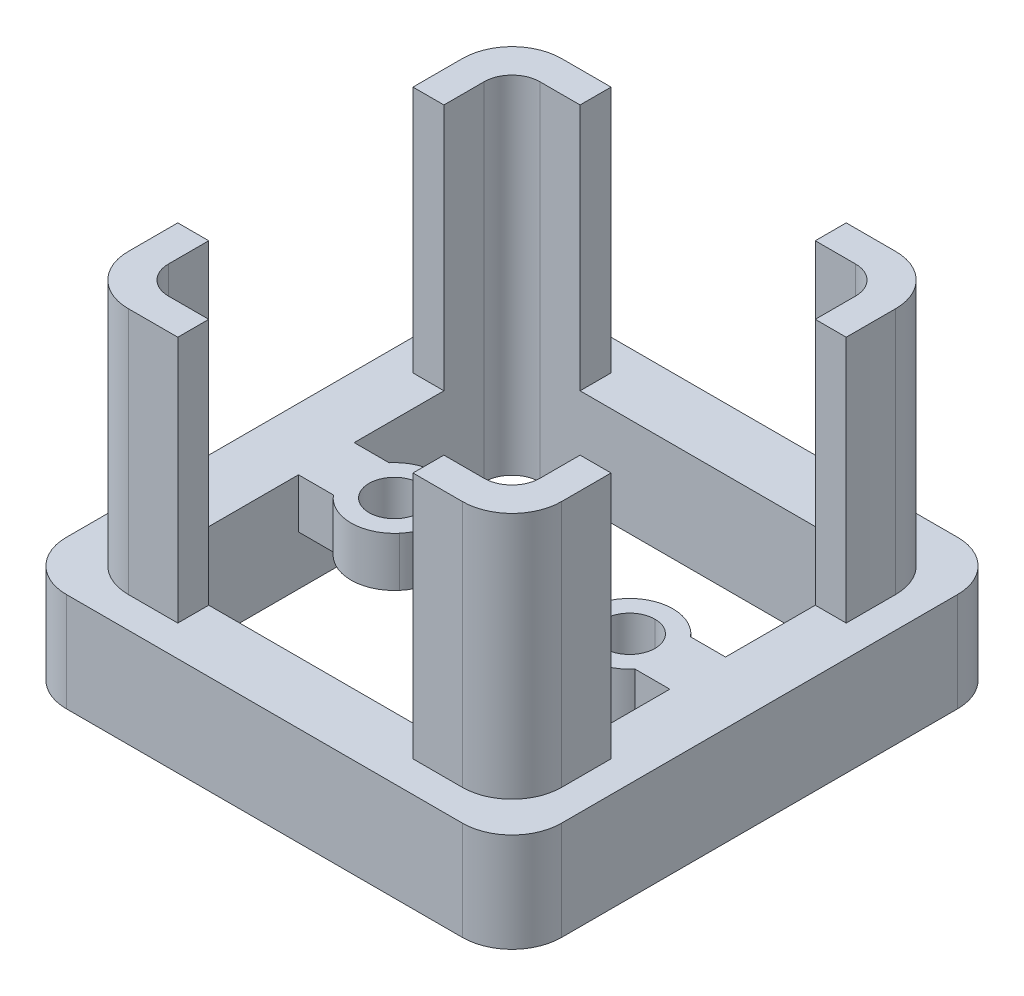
ISO-10303-21;
HEADER;
FILE_DESCRIPTION(('STEP AP214'),'2;1');
FILE_NAME('part.step','',(''),(''),'','','');
FILE_SCHEMA(('AUTOMOTIVE_DESIGN { 1 0 10303 214 1 1 1 1 }'));
ENDSEC;
DATA;
#1=APPLICATION_CONTEXT('core data for automotive mechanical design processes');
#2=APPLICATION_PROTOCOL_DEFINITION('international standard','automotive_design',2000,#1);
#3=PRODUCT_CONTEXT('',#1,'mechanical');
#4=PRODUCT('Part','Part','',(#3));
#5=PRODUCT_RELATED_PRODUCT_CATEGORY('part','',(#4));
#6=PRODUCT_DEFINITION_FORMATION('','',#4);
#7=PRODUCT_DEFINITION_CONTEXT('part definition',#1,'design');
#8=PRODUCT_DEFINITION('design','',#6,#7);
#9=PRODUCT_DEFINITION_SHAPE('','',#8);
#10=(LENGTH_UNIT() NAMED_UNIT(*) SI_UNIT(.MILLI.,.METRE.));
#11=(NAMED_UNIT(*) PLANE_ANGLE_UNIT() SI_UNIT($,.RADIAN.));
#12=(NAMED_UNIT(*) SI_UNIT($,.STERADIAN.) SOLID_ANGLE_UNIT());
#13=UNCERTAINTY_MEASURE_WITH_UNIT(LENGTH_MEASURE(1.E-05),#10,'distance_accuracy_value','');
#14=(GEOMETRIC_REPRESENTATION_CONTEXT(3) GLOBAL_UNCERTAINTY_ASSIGNED_CONTEXT((#13)) GLOBAL_UNIT_ASSIGNED_CONTEXT((#10,
#11,#12)) REPRESENTATION_CONTEXT('',''));
#15=CARTESIAN_POINT('',(0.,0.,0.));
#16=DIRECTION('',(0.,0.,1.));
#17=DIRECTION('',(1.,0.,0.));
#18=AXIS2_PLACEMENT_3D('',#15,#16,#17);
#19=CARTESIAN_POINT('',(20.,-134.,0.));
#20=DIRECTION('',(-1.,0.,0.));
#21=DIRECTION('',(0.,0.,1.));
#22=AXIS2_PLACEMENT_3D('',#19,#20,#21);
#23=PLANE('',#22);
#24=DIRECTION('',(0.,1.,0.));
#25=VECTOR('',#24,1.);
#26=CARTESIAN_POINT('',(20.,-134.,15.9999999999));
#27=LINE('',#26,#25);
#28=CARTESIAN_POINT('',(20.,-138.,16.));
#29=VERTEX_POINT('',#28);
#30=CARTESIAN_POINT('',(20.,-130.,16.));
#31=VERTEX_POINT('',#30);
#32=EDGE_CURVE('E773',#29,#31,#27,.T.);
#33=ORIENTED_EDGE('',*,*,#32,.F.);
#34=DIRECTION('',(0.,0.,-1.));
#35=VECTOR('',#34,1.);
#36=CARTESIAN_POINT('',(20.,-138.,0.));
#37=LINE('',#36,#35);
#38=CARTESIAN_POINT('',(19.9999999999,-138.,-15.9999999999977));
#39=VERTEX_POINT('',#38);
#40=EDGE_CURVE('E48',#29,#39,#37,.T.);
#41=ORIENTED_EDGE('',*,*,#40,.T.);
#42=DIRECTION('',(0.,1.,0.));
#43=VECTOR('',#42,1.);
#44=CARTESIAN_POINT('',(20.,-134.,-15.9999999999));
#45=LINE('',#44,#43);
#46=CARTESIAN_POINT('',(19.9999999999,-130.,-15.9999999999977));
#47=VERTEX_POINT('',#46);
#48=EDGE_CURVE('E651',#39,#47,#45,.T.);
#49=ORIENTED_EDGE('',*,*,#48,.T.);
#50=DIRECTION('',(0.,0.,-1.));
#51=VECTOR('',#50,1.);
#52=CARTESIAN_POINT('',(20.,-130.,0.));
#53=LINE('',#52,#51);
#54=EDGE_CURVE('E42',#31,#47,#53,.T.);
#55=ORIENTED_EDGE('',*,*,#54,.F.);
#56=EDGE_LOOP('',(#33,#41,#49,#55));
#57=FACE_BOUND('',#56,.T.);
#58=ADVANCED_FACE('F38',(#57),#23,.F.);
#59=CARTESIAN_POINT('',(-20.,-134.,0.));
#60=DIRECTION('',(1.,0.,0.));
#61=DIRECTION('',(0.,1.,0.));
#62=AXIS2_PLACEMENT_3D('',#59,#60,#61);
#63=PLANE('',#62);
#64=DIRECTION('',(0.,1.,0.));
#65=VECTOR('',#64,1.);
#66=CARTESIAN_POINT('',(-20.,-134.,-15.9999999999));
#67=LINE('',#66,#65);
#68=CARTESIAN_POINT('',(-20.,-138.,-16.));
#69=VERTEX_POINT('',#68);
#70=CARTESIAN_POINT('',(-20.,-130.,-16.));
#71=VERTEX_POINT('',#70);
#72=EDGE_CURVE('E583',#69,#71,#67,.T.);
#73=ORIENTED_EDGE('',*,*,#72,.F.);
#74=DIRECTION('',(0.,0.,-1.));
#75=VECTOR('',#74,1.);
#76=CARTESIAN_POINT('',(-20.,-138.,0.));
#77=LINE('',#76,#75);
#78=CARTESIAN_POINT('',(-19.9999999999,-138.,15.9999999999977));
#79=VERTEX_POINT('',#78);
#80=EDGE_CURVE('E11',#79,#69,#77,.T.);
#81=ORIENTED_EDGE('',*,*,#80,.F.);
#82=DIRECTION('',(0.,1.,0.));
#83=VECTOR('',#82,1.);
#84=CARTESIAN_POINT('',(-20.,-134.,15.9999999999));
#85=LINE('',#84,#83);
#86=CARTESIAN_POINT('',(-19.9999999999,-130.,15.9999999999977));
#87=VERTEX_POINT('',#86);
#88=EDGE_CURVE('E418',#79,#87,#85,.T.);
#89=ORIENTED_EDGE('',*,*,#88,.T.);
#90=DIRECTION('',(0.,0.,-1.));
#91=VECTOR('',#90,1.);
#92=CARTESIAN_POINT('',(-20.,-130.,0.));
#93=LINE('',#92,#91);
#94=EDGE_CURVE('E442',#87,#71,#93,.T.);
#95=ORIENTED_EDGE('',*,*,#94,.T.);
#96=EDGE_LOOP('',(#73,#81,#89,#95));
#97=FACE_BOUND('',#96,.T.);
#98=ADVANCED_FACE('F977',(#97),#63,.F.);
#99=CARTESIAN_POINT('',(0.,-138.,0.));
#100=DIRECTION('',(0.,1.,0.));
#101=DIRECTION('',(1.,0.,0.));
#102=AXIS2_PLACEMENT_3D('',#99,#100,#101);
#103=PLANE('',#102);
#104=CARTESIAN_POINT('',(-12.75,-138.,-12.75));
#105=DIRECTION('',(0.,1.,0.));
#106=DIRECTION('',(-1.,0.,0.));
#107=AXIS2_PLACEMENT_3D('',#104,#105,#106);
#108=CIRCLE('',#107,2.25);
#109=CARTESIAN_POINT('',(-12.75,-138.,-15.));
#110=VERTEX_POINT('',#109);
#111=CARTESIAN_POINT('',(-15.,-138.,-12.75));
#112=VERTEX_POINT('',#111);
#113=EDGE_CURVE('E390',#110,#112,#108,.T.);
#114=ORIENTED_EDGE('',*,*,#113,.T.);
#115=DIRECTION('',(0.,0.,1.));
#116=VECTOR('',#115,1.);
#117=CARTESIAN_POINT('',(-15.,-138.,0.));
#118=LINE('',#117,#116);
#119=CARTESIAN_POINT('',(-15.,-138.,12.75));
#120=VERTEX_POINT('',#119);
#121=EDGE_CURVE('E486',#112,#120,#118,.T.);
#122=ORIENTED_EDGE('',*,*,#121,.T.);
#123=CARTESIAN_POINT('',(-12.75,-138.,12.75));
#124=DIRECTION('',(0.,1.,0.));
#125=DIRECTION('',(0.,0.,1.));
#126=AXIS2_PLACEMENT_3D('',#123,#124,#125);
#127=CIRCLE('',#126,2.25);
#128=CARTESIAN_POINT('',(-12.75,-138.,15.));
#129=VERTEX_POINT('',#128);
#130=EDGE_CURVE('E392',#120,#129,#127,.T.);
#131=ORIENTED_EDGE('',*,*,#130,.T.);
#132=DIRECTION('',(1.,0.,0.));
#133=VECTOR('',#132,1.);
#134=CARTESIAN_POINT('',(0.,-138.,15.));
#135=LINE('',#134,#133);
#136=CARTESIAN_POINT('',(12.75,-138.,15.));
#137=VERTEX_POINT('',#136);
#138=EDGE_CURVE('E558',#129,#137,#135,.T.);
#139=ORIENTED_EDGE('',*,*,#138,.T.);
#140=CARTESIAN_POINT('',(12.75,-138.,12.75));
#141=DIRECTION('',(0.,1.,0.));
#142=DIRECTION('',(1.,0.,0.));
#143=AXIS2_PLACEMENT_3D('',#140,#141,#142);
#144=CIRCLE('',#143,2.25);
#145=CARTESIAN_POINT('',(15.,-138.,12.75));
#146=VERTEX_POINT('',#145);
#147=EDGE_CURVE('E524',#137,#146,#144,.T.);
#148=ORIENTED_EDGE('',*,*,#147,.T.);
#149=DIRECTION('',(0.,0.,-1.));
#150=VECTOR('',#149,1.);
#151=CARTESIAN_POINT('',(15.,-138.,0.));
#152=LINE('',#151,#150);
#153=CARTESIAN_POINT('',(15.,-138.,-12.75));
#154=VERTEX_POINT('',#153);
#155=EDGE_CURVE('E779',#146,#154,#152,.T.);
#156=ORIENTED_EDGE('',*,*,#155,.T.);
#157=CARTESIAN_POINT('',(12.75,-138.,-12.75));
#158=DIRECTION('',(0.,1.,0.));
#159=DIRECTION('',(0.,0.,-1.));
#160=AXIS2_PLACEMENT_3D('',#157,#158,#159);
#161=CIRCLE('',#160,2.25);
#162=CARTESIAN_POINT('',(12.75,-138.,-15.));
#163=VERTEX_POINT('',#162);
#164=EDGE_CURVE('E683',#154,#163,#161,.T.);
#165=ORIENTED_EDGE('',*,*,#164,.T.);
#166=DIRECTION('',(-1.,0.,0.));
#167=VECTOR('',#166,1.);
#168=CARTESIAN_POINT('',(0.,-138.,-15.));
#169=LINE('',#168,#167);
#170=EDGE_CURVE('E682',#163,#110,#169,.T.);
#171=ORIENTED_EDGE('',*,*,#170,.T.);
#172=EDGE_LOOP('',(#114,#122,#131,#139,#148,#156,#165,#171));
#173=FACE_BOUND('',#172,.T.);
#174=CARTESIAN_POINT('',(-15.9999999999,-138.,-15.9999999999));
#175=DIRECTION('',(0.,-1.,0.));
#176=DIRECTION('',(-1.,0.,-2.44313458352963E-11));
#177=AXIS2_PLACEMENT_3D('',#174,#175,#176);
#178=CIRCLE('',#177,4.);
#179=CARTESIAN_POINT('',(-15.9999999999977,-138.,-19.9999999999));
#180=VERTEX_POINT('',#179);
#181=EDGE_CURVE('E580',#69,#180,#178,.T.);
#182=ORIENTED_EDGE('',*,*,#181,.T.);
#183=DIRECTION('',(-1.,0.,0.));
#184=VECTOR('',#183,1.);
#185=CARTESIAN_POINT('',(0.,-138.,-20.));
#186=LINE('',#185,#184);
#187=CARTESIAN_POINT('',(15.9999999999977,-138.,-19.9999999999));
#188=VERTEX_POINT('',#187);
#189=EDGE_CURVE('E731',#188,#180,#186,.T.);
#190=ORIENTED_EDGE('',*,*,#189,.F.);
#191=CARTESIAN_POINT('',(15.9999999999,-138.,-15.9999999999));
#192=DIRECTION('',(0.,-1.,0.));
#193=DIRECTION('',(2.443512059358E-11,0.,-1.));
#194=AXIS2_PLACEMENT_3D('',#191,#192,#193);
#195=CIRCLE('',#194,4.);
#196=EDGE_CURVE('E506',#188,#39,#195,.T.);
#197=ORIENTED_EDGE('',*,*,#196,.T.);
#198=ORIENTED_EDGE('',*,*,#40,.F.);
#199=CARTESIAN_POINT('',(15.9999999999,-138.,15.9999999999));
#200=DIRECTION('',(0.,-1.,0.));
#201=DIRECTION('',(1.,0.,2.44302356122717E-11));
#202=AXIS2_PLACEMENT_3D('',#199,#200,#201);
#203=CIRCLE('',#202,4.);
#204=CARTESIAN_POINT('',(15.9999999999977,-138.,19.9999999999));
#205=VERTEX_POINT('',#204);
#206=EDGE_CURVE('E770',#29,#205,#203,.T.);
#207=ORIENTED_EDGE('',*,*,#206,.T.);
#208=DIRECTION('',(1.,0.,0.));
#209=VECTOR('',#208,1.);
#210=CARTESIAN_POINT('',(0.,-138.,20.));
#211=LINE('',#210,#209);
#212=CARTESIAN_POINT('',(-16.,-138.,20.));
#213=VERTEX_POINT('',#212);
#214=EDGE_CURVE('E692',#213,#205,#211,.T.);
#215=ORIENTED_EDGE('',*,*,#214,.F.);
#216=CARTESIAN_POINT('',(-15.9999999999,-138.,15.9999999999));
#217=DIRECTION('',(0.,-1.,0.));
#218=DIRECTION('',(-2.44364528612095E-11,0.,1.));
#219=AXIS2_PLACEMENT_3D('',#216,#217,#218);
#220=CIRCLE('',#219,4.);
#221=EDGE_CURVE('E511',#213,#79,#220,.T.);
#222=ORIENTED_EDGE('',*,*,#221,.T.);
#223=ORIENTED_EDGE('',*,*,#80,.T.);
#224=EDGE_LOOP('',(#182,#190,#197,#198,#207,#215,#222,#223));
#225=FACE_BOUND('',#224,.T.);
#226=ADVANCED_FACE('F947',(#173,#225),#103,.F.);
#227=CARTESIAN_POINT('',(0.,-134.,-20.));
#228=DIRECTION('',(0.,0.,1.));
#229=DIRECTION('',(1.,0.,0.));
#230=AXIS2_PLACEMENT_3D('',#227,#228,#229);
#231=PLANE('',#230);
#232=DIRECTION('',(0.,1.,0.));
#233=VECTOR('',#232,1.);
#234=CARTESIAN_POINT('',(-15.9999999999,-134.,-20.));
#235=LINE('',#234,#233);
#236=CARTESIAN_POINT('',(-15.9999999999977,-130.,-19.9999999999));
#237=VERTEX_POINT('',#236);
#238=EDGE_CURVE('E503',#180,#237,#235,.T.);
#239=ORIENTED_EDGE('',*,*,#238,.T.);
#240=DIRECTION('',(1.,0.,0.));
#241=VECTOR('',#240,1.);
#242=CARTESIAN_POINT('',(0.,-130.,-20.));
#243=LINE('',#242,#241);
#244=CARTESIAN_POINT('',(15.9999999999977,-130.,-19.9999999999));
#245=VERTEX_POINT('',#244);
#246=EDGE_CURVE('E690',#237,#245,#243,.T.);
#247=ORIENTED_EDGE('',*,*,#246,.T.);
#248=DIRECTION('',(0.,-1.,0.));
#249=VECTOR('',#248,1.);
#250=CARTESIAN_POINT('',(15.9999999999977,-132.,-19.9999999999));
#251=LINE('',#250,#249);
#252=EDGE_CURVE('E604',#245,#188,#251,.T.);
#253=ORIENTED_EDGE('',*,*,#252,.T.);
#254=ORIENTED_EDGE('',*,*,#189,.T.);
#255=EDGE_LOOP('',(#239,#247,#253,#254));
#256=FACE_BOUND('',#255,.T.);
#257=ADVANCED_FACE('F1024',(#256),#231,.F.);
#258=CARTESIAN_POINT('',(0.,-134.,20.));
#259=DIRECTION('',(0.,0.,1.));
#260=DIRECTION('',(1.,0.,0.));
#261=AXIS2_PLACEMENT_3D('',#258,#259,#260);
#262=PLANE('',#261);
#263=DIRECTION('',(0.,1.,0.));
#264=VECTOR('',#263,1.);
#265=CARTESIAN_POINT('',(-15.9999999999,-134.,20.));
#266=LINE('',#265,#264);
#267=CARTESIAN_POINT('',(-16.,-130.,20.));
#268=VERTEX_POINT('',#267);
#269=EDGE_CURVE('E419',#213,#268,#266,.T.);
#270=ORIENTED_EDGE('',*,*,#269,.F.);
#271=ORIENTED_EDGE('',*,*,#214,.T.);
#272=DIRECTION('',(0.,1.,0.));
#273=VECTOR('',#272,1.);
#274=CARTESIAN_POINT('',(15.9999999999,-134.,20.));
#275=LINE('',#274,#273);
#276=CARTESIAN_POINT('',(15.9999999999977,-130.,19.9999999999));
#277=VERTEX_POINT('',#276);
#278=EDGE_CURVE('E514',#205,#277,#275,.T.);
#279=ORIENTED_EDGE('',*,*,#278,.T.);
#280=DIRECTION('',(-1.,0.,0.));
#281=VECTOR('',#280,1.);
#282=CARTESIAN_POINT('',(0.,-130.,20.));
#283=LINE('',#282,#281);
#284=EDGE_CURVE('E440',#277,#268,#283,.T.);
#285=ORIENTED_EDGE('',*,*,#284,.T.);
#286=EDGE_LOOP('',(#270,#271,#279,#285));
#287=FACE_BOUND('',#286,.T.);
#288=ADVANCED_FACE('F1021',(#287),#262,.T.);
#289=CARTESIAN_POINT('',(0.,-130.,0.));
#290=DIRECTION('',(0.,-1.,0.));
#291=DIRECTION('',(0.,0.,-1.));
#292=AXIS2_PLACEMENT_3D('',#289,#290,#291);
#293=PLANE('',#292);
#294=DIRECTION('',(-1.,0.,0.));
#295=VECTOR('',#294,1.);
#296=CARTESIAN_POINT('',(8.125,-130.,-9.5));
#297=LINE('',#296,#295);
#298=CARTESIAN_POINT('',(17.5,-130.,-9.5));
#299=VERTEX_POINT('',#298);
#300=CARTESIAN_POINT('',(15.,-130.,-9.5));
#301=VERTEX_POINT('',#300);
#302=EDGE_CURVE('E608',#299,#301,#297,.T.);
#303=ORIENTED_EDGE('',*,*,#302,.T.);
#304=DIRECTION('',(0.,0.,1.));
#305=VECTOR('',#304,1.);
#306=CARTESIAN_POINT('',(15.,-130.,0.));
#307=LINE('',#306,#305);
#308=CARTESIAN_POINT('',(15.,-130.,-2.25));
#309=VERTEX_POINT('',#308);
#310=EDGE_CURVE('E596',#301,#309,#307,.T.);
#311=ORIENTED_EDGE('',*,*,#310,.T.);
#312=DIRECTION('',(-1.,0.,0.));
#313=VECTOR('',#312,1.);
#314=CARTESIAN_POINT('',(15.,-130.,-2.25));
#315=LINE('',#314,#313);
#316=CARTESIAN_POINT('',(12.18095132,-130.,-2.25));
#317=VERTEX_POINT('',#316);
#318=EDGE_CURVE('E430',#309,#317,#315,.T.);
#319=ORIENTED_EDGE('',*,*,#318,.T.);
#320=CARTESIAN_POINT('',(9.5,-130.,0.));
#321=DIRECTION('',(0.,-1.,0.));
#322=DIRECTION('',(0.765986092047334,0.,0.642857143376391));
#323=AXIS2_PLACEMENT_3D('',#320,#321,#322);
#324=CIRCLE('',#323,3.4999999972);
#325=CARTESIAN_POINT('',(6.81904867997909,-130.,-2.25000000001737));
#326=VERTEX_POINT('',#325);
#327=EDGE_CURVE('E465',#326,#317,#324,.T.);
#328=ORIENTED_EDGE('',*,*,#327,.F.);
#329=CARTESIAN_POINT('',(9.5,-130.,0.));
#330=DIRECTION('',(0.,-1.,0.));
#331=DIRECTION('',(0.765986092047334,0.,0.642857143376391));
#332=AXIS2_PLACEMENT_3D('',#329,#330,#331);
#333=CIRCLE('',#332,3.4999999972);
#334=CARTESIAN_POINT('',(12.18095132,-130.,2.25));
#335=VERTEX_POINT('',#334);
#336=EDGE_CURVE('E413',#335,#326,#333,.T.);
#337=ORIENTED_EDGE('',*,*,#336,.F.);
#338=DIRECTION('',(1.,0.,0.));
#339=VECTOR('',#338,1.);
#340=CARTESIAN_POINT('',(12.18095132,-130.,2.25));
#341=LINE('',#340,#339);
#342=CARTESIAN_POINT('',(15.,-130.,2.25));
#343=VERTEX_POINT('',#342);
#344=EDGE_CURVE('E323',#335,#343,#341,.T.);
#345=ORIENTED_EDGE('',*,*,#344,.T.);
#346=DIRECTION('',(0.,0.,1.));
#347=VECTOR('',#346,1.);
#348=CARTESIAN_POINT('',(15.,-130.,0.));
#349=LINE('',#348,#347);
#350=CARTESIAN_POINT('',(15.,-130.,9.5));
#351=VERTEX_POINT('',#350);
#352=EDGE_CURVE('E569',#343,#351,#349,.T.);
#353=ORIENTED_EDGE('',*,*,#352,.T.);
#354=DIRECTION('',(1.,0.,0.));
#355=VECTOR('',#354,1.);
#356=CARTESIAN_POINT('',(8.125,-130.,9.5));
#357=LINE('',#356,#355);
#358=CARTESIAN_POINT('',(17.5,-130.,9.5));
#359=VERTEX_POINT('',#358);
#360=EDGE_CURVE('E533',#351,#359,#357,.T.);
#361=ORIENTED_EDGE('',*,*,#360,.T.);
#362=DIRECTION('',(0.,0.,1.));
#363=VECTOR('',#362,1.);
#364=CARTESIAN_POINT('',(17.5,-130.,5.75));
#365=LINE('',#364,#363);
#366=CARTESIAN_POINT('',(17.5,-130.,13.5));
#367=VERTEX_POINT('',#366);
#368=EDGE_CURVE('E601',#359,#367,#365,.T.);
#369=ORIENTED_EDGE('',*,*,#368,.T.);
#370=CARTESIAN_POINT('',(13.5,-130.,13.5));
#371=DIRECTION('',(0.,-1.,0.));
#372=DIRECTION('',(0.,0.,1.));
#373=AXIS2_PLACEMENT_3D('',#370,#371,#372);
#374=CIRCLE('',#373,4.);
#375=CARTESIAN_POINT('',(13.5,-130.,17.5));
#376=VERTEX_POINT('',#375);
#377=EDGE_CURVE('E491',#367,#376,#374,.T.);
#378=ORIENTED_EDGE('',*,*,#377,.T.);
#379=DIRECTION('',(-1.,0.,0.));
#380=VECTOR('',#379,1.);
#381=CARTESIAN_POINT('',(5.75,-130.,17.5));
#382=LINE('',#381,#380);
#383=CARTESIAN_POINT('',(9.5,-130.,17.5));
#384=VERTEX_POINT('',#383);
#385=EDGE_CURVE('E498',#376,#384,#382,.T.);
#386=ORIENTED_EDGE('',*,*,#385,.T.);
#387=DIRECTION('',(0.,0.,-1.));
#388=VECTOR('',#387,1.);
#389=CARTESIAN_POINT('',(9.5,-130.,8.125));
#390=LINE('',#389,#388);
#391=CARTESIAN_POINT('',(9.5,-130.,15.));
#392=VERTEX_POINT('',#391);
#393=EDGE_CURVE('E662',#384,#392,#390,.T.);
#394=ORIENTED_EDGE('',*,*,#393,.T.);
#395=DIRECTION('',(-1.,0.,0.));
#396=VECTOR('',#395,1.);
#397=CARTESIAN_POINT('',(0.,-130.,15.));
#398=LINE('',#397,#396);
#399=CARTESIAN_POINT('',(-9.5,-130.,15.));
#400=VERTEX_POINT('',#399);
#401=EDGE_CURVE('E525',#392,#400,#398,.T.);
#402=ORIENTED_EDGE('',*,*,#401,.T.);
#403=DIRECTION('',(0.,0.,1.));
#404=VECTOR('',#403,1.);
#405=CARTESIAN_POINT('',(-9.5,-130.,8.125));
#406=LINE('',#405,#404);
#407=CARTESIAN_POINT('',(-9.5,-130.,17.5));
#408=VERTEX_POINT('',#407);
#409=EDGE_CURVE('E451',#400,#408,#406,.T.);
#410=ORIENTED_EDGE('',*,*,#409,.T.);
#411=DIRECTION('',(-1.,0.,0.));
#412=VECTOR('',#411,1.);
#413=CARTESIAN_POINT('',(-5.75,-130.,17.5));
#414=LINE('',#413,#412);
#415=CARTESIAN_POINT('',(-13.5,-130.,17.5));
#416=VERTEX_POINT('',#415);
#417=EDGE_CURVE('E574',#408,#416,#414,.T.);
#418=ORIENTED_EDGE('',*,*,#417,.T.);
#419=CARTESIAN_POINT('',(-13.5,-130.,13.5));
#420=DIRECTION('',(0.,-1.,0.));
#421=DIRECTION('',(-1.,0.,0.));
#422=AXIS2_PLACEMENT_3D('',#419,#420,#421);
#423=CIRCLE('',#422,4.);
#424=CARTESIAN_POINT('',(-17.5,-130.,13.5));
#425=VERTEX_POINT('',#424);
#426=EDGE_CURVE('E444',#416,#425,#423,.T.);
#427=ORIENTED_EDGE('',*,*,#426,.T.);
#428=DIRECTION('',(0.,0.,-1.));
#429=VECTOR('',#428,1.);
#430=CARTESIAN_POINT('',(-17.5,-130.,5.75));
#431=LINE('',#430,#429);
#432=CARTESIAN_POINT('',(-17.5,-130.,9.5));
#433=VERTEX_POINT('',#432);
#434=EDGE_CURVE('E438',#425,#433,#431,.T.);
#435=ORIENTED_EDGE('',*,*,#434,.T.);
#436=DIRECTION('',(1.,0.,0.));
#437=VECTOR('',#436,1.);
#438=CARTESIAN_POINT('',(-8.125,-130.,9.5));
#439=LINE('',#438,#437);
#440=CARTESIAN_POINT('',(-15.,-130.,9.5));
#441=VERTEX_POINT('',#440);
#442=EDGE_CURVE('E445',#433,#441,#439,.T.);
#443=ORIENTED_EDGE('',*,*,#442,.T.);
#444=DIRECTION('',(0.,0.,-1.));
#445=VECTOR('',#444,1.);
#446=CARTESIAN_POINT('',(-15.,-130.,0.));
#447=LINE('',#446,#445);
#448=CARTESIAN_POINT('',(-15.,-130.,2.25));
#449=VERTEX_POINT('',#448);
#450=EDGE_CURVE('E557',#441,#449,#447,.T.);
#451=ORIENTED_EDGE('',*,*,#450,.T.);
#452=DIRECTION('',(1.,0.,0.));
#453=VECTOR('',#452,1.);
#454=CARTESIAN_POINT('',(-15.,-130.,2.25));
#455=LINE('',#454,#453);
#456=CARTESIAN_POINT('',(-12.18095132,-130.,2.25));
#457=VERTEX_POINT('',#456);
#458=EDGE_CURVE('E588',#449,#457,#455,.T.);
#459=ORIENTED_EDGE('',*,*,#458,.T.);
#460=CARTESIAN_POINT('',(-9.5,-130.,0.));
#461=DIRECTION('',(0.,-1.,0.));
#462=DIRECTION('',(-0.765986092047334,0.,-0.642857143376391));
#463=AXIS2_PLACEMENT_3D('',#460,#461,#462);
#464=CIRCLE('',#463,3.4999999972);
#465=CARTESIAN_POINT('',(-6.81904867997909,-130.,2.25000000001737));
#466=VERTEX_POINT('',#465);
#467=EDGE_CURVE('E587',#466,#457,#464,.T.);
#468=ORIENTED_EDGE('',*,*,#467,.F.);
#469=CARTESIAN_POINT('',(-9.5,-130.,0.));
#470=DIRECTION('',(0.,-1.,0.));
#471=DIRECTION('',(-0.765986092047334,0.,-0.642857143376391));
#472=AXIS2_PLACEMENT_3D('',#469,#470,#471);
#473=CIRCLE('',#472,3.4999999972);
#474=CARTESIAN_POINT('',(-12.18095132,-130.,-2.25));
#475=VERTEX_POINT('',#474);
#476=EDGE_CURVE('E637',#475,#466,#473,.T.);
#477=ORIENTED_EDGE('',*,*,#476,.F.);
#478=DIRECTION('',(-1.,0.,0.));
#479=VECTOR('',#478,1.);
#480=CARTESIAN_POINT('',(-12.18095132,-130.,-2.25));
#481=LINE('',#480,#479);
#482=CARTESIAN_POINT('',(-15.,-130.,-2.25));
#483=VERTEX_POINT('',#482);
#484=EDGE_CURVE('E493',#475,#483,#481,.T.);
#485=ORIENTED_EDGE('',*,*,#484,.T.);
#486=DIRECTION('',(0.,0.,-1.));
#487=VECTOR('',#486,1.);
#488=CARTESIAN_POINT('',(-15.,-130.,0.));
#489=LINE('',#488,#487);
#490=CARTESIAN_POINT('',(-15.,-130.,-9.5));
#491=VERTEX_POINT('',#490);
#492=EDGE_CURVE('E425',#483,#491,#489,.T.);
#493=ORIENTED_EDGE('',*,*,#492,.T.);
#494=DIRECTION('',(-1.,0.,0.));
#495=VECTOR('',#494,1.);
#496=CARTESIAN_POINT('',(-8.125,-130.,-9.5));
#497=LINE('',#496,#495);
#498=CARTESIAN_POINT('',(-17.5,-130.,-9.5));
#499=VERTEX_POINT('',#498);
#500=EDGE_CURVE('E407',#491,#499,#497,.T.);
#501=ORIENTED_EDGE('',*,*,#500,.T.);
#502=DIRECTION('',(0.,0.,-1.));
#503=VECTOR('',#502,1.);
#504=CARTESIAN_POINT('',(-17.5,-130.,-5.75));
#505=LINE('',#504,#503);
#506=CARTESIAN_POINT('',(-17.5,-130.,-13.5));
#507=VERTEX_POINT('',#506);
#508=EDGE_CURVE('E629',#499,#507,#505,.T.);
#509=ORIENTED_EDGE('',*,*,#508,.T.);
#510=CARTESIAN_POINT('',(-13.5,-130.,-13.5));
#511=DIRECTION('',(0.,-1.,0.));
#512=DIRECTION('',(0.,0.,-1.));
#513=AXIS2_PLACEMENT_3D('',#510,#511,#512);
#514=CIRCLE('',#513,4.);
#515=CARTESIAN_POINT('',(-13.5,-130.,-17.5));
#516=VERTEX_POINT('',#515);
#517=EDGE_CURVE('E423',#507,#516,#514,.T.);
#518=ORIENTED_EDGE('',*,*,#517,.T.);
#519=DIRECTION('',(1.,0.,0.));
#520=VECTOR('',#519,1.);
#521=CARTESIAN_POINT('',(-5.75,-130.,-17.5));
#522=LINE('',#521,#520);
#523=CARTESIAN_POINT('',(-9.5,-130.,-17.5));
#524=VERTEX_POINT('',#523);
#525=EDGE_CURVE('E482',#516,#524,#522,.T.);
#526=ORIENTED_EDGE('',*,*,#525,.T.);
#527=DIRECTION('',(0.,0.,1.));
#528=VECTOR('',#527,1.);
#529=CARTESIAN_POINT('',(-9.5,-130.,-8.125));
#530=LINE('',#529,#528);
#531=CARTESIAN_POINT('',(-9.5,-130.,-15.));
#532=VERTEX_POINT('',#531);
#533=EDGE_CURVE('E614',#524,#532,#530,.T.);
#534=ORIENTED_EDGE('',*,*,#533,.T.);
#535=DIRECTION('',(1.,0.,0.));
#536=VECTOR('',#535,1.);
#537=CARTESIAN_POINT('',(0.,-130.,-15.));
#538=LINE('',#537,#536);
#539=CARTESIAN_POINT('',(9.5,-130.,-15.));
#540=VERTEX_POINT('',#539);
#541=EDGE_CURVE('E774',#532,#540,#538,.T.);
#542=ORIENTED_EDGE('',*,*,#541,.T.);
#543=DIRECTION('',(0.,0.,-1.));
#544=VECTOR('',#543,1.);
#545=CARTESIAN_POINT('',(9.5,-130.,-8.125));
#546=LINE('',#545,#544);
#547=CARTESIAN_POINT('',(9.5,-130.,-17.5));
#548=VERTEX_POINT('',#547);
#549=EDGE_CURVE('E703',#540,#548,#546,.T.);
#550=ORIENTED_EDGE('',*,*,#549,.T.);
#551=DIRECTION('',(1.,0.,0.));
#552=VECTOR('',#551,1.);
#553=CARTESIAN_POINT('',(5.75,-130.,-17.5));
#554=LINE('',#553,#552);
#555=CARTESIAN_POINT('',(13.5,-130.,-17.5));
#556=VERTEX_POINT('',#555);
#557=EDGE_CURVE('E636',#548,#556,#554,.T.);
#558=ORIENTED_EDGE('',*,*,#557,.T.);
#559=CARTESIAN_POINT('',(13.5,-130.,-13.5));
#560=DIRECTION('',(0.,-1.,0.));
#561=DIRECTION('',(1.,0.,0.));
#562=AXIS2_PLACEMENT_3D('',#559,#560,#561);
#563=CIRCLE('',#562,4.);
#564=CARTESIAN_POINT('',(17.5,-130.,-13.5));
#565=VERTEX_POINT('',#564);
#566=EDGE_CURVE('E624',#556,#565,#563,.T.);
#567=ORIENTED_EDGE('',*,*,#566,.T.);
#568=DIRECTION('',(0.,0.,1.));
#569=VECTOR('',#568,1.);
#570=CARTESIAN_POINT('',(17.5,-130.,-5.75));
#571=LINE('',#570,#569);
#572=EDGE_CURVE('E471',#565,#299,#571,.T.);
#573=ORIENTED_EDGE('',*,*,#572,.T.);
#574=EDGE_LOOP('',(#303,#311,#319,#328,#337,#345,#353,#361,#369,#378,#386,#394,#402,#410,#418,
#427,#435,#443,#451,#459,#468,#477,#485,#493,#501,#509,#518,#526,#534,#542,#550,#558,#567,#573));
#575=FACE_BOUND('',#574,.T.);
#576=CARTESIAN_POINT('',(-9.5,-130.,0.));
#577=DIRECTION('',(0.,-1.,0.));
#578=DIRECTION('',(0.,0.,1.));
#579=AXIS2_PLACEMENT_3D('',#576,#577,#578);
#580=CIRCLE('',#579,2.05);
#581=CARTESIAN_POINT('',(-9.5,-130.,2.05));
#582=VERTEX_POINT('',#581);
#583=CARTESIAN_POINT('',(-9.5,-130.,-2.05));
#584=VERTEX_POINT('',#583);
#585=EDGE_CURVE('E545',#582,#584,#580,.T.);
#586=ORIENTED_EDGE('',*,*,#585,.T.);
#587=CARTESIAN_POINT('',(-9.5,-130.,0.));
#588=DIRECTION('',(0.,-1.,0.));
#589=DIRECTION('',(0.,0.,1.));
#590=AXIS2_PLACEMENT_3D('',#587,#588,#589);
#591=CIRCLE('',#590,2.05);
#592=EDGE_CURVE('E657',#584,#582,#591,.T.);
#593=ORIENTED_EDGE('',*,*,#592,.T.);
#594=EDGE_LOOP('',(#586,#593));
#595=FACE_BOUND('',#594,.T.);
#596=CARTESIAN_POINT('',(9.5,-130.,0.));
#597=DIRECTION('',(0.,-1.,0.));
#598=DIRECTION('',(0.,0.,-1.));
#599=AXIS2_PLACEMENT_3D('',#596,#597,#598);
#600=CIRCLE('',#599,2.05);
#601=CARTESIAN_POINT('',(9.5,-130.,-2.05));
#602=VERTEX_POINT('',#601);
#603=CARTESIAN_POINT('',(9.5,-130.,2.05));
#604=VERTEX_POINT('',#603);
#605=EDGE_CURVE('E463',#602,#604,#600,.T.);
#606=ORIENTED_EDGE('',*,*,#605,.T.);
#607=CARTESIAN_POINT('',(9.5,-130.,0.));
#608=DIRECTION('',(0.,-1.,0.));
#609=DIRECTION('',(0.,0.,-1.));
#610=AXIS2_PLACEMENT_3D('',#607,#608,#609);
#611=CIRCLE('',#610,2.05);
#612=EDGE_CURVE('E475',#604,#602,#611,.T.);
#613=ORIENTED_EDGE('',*,*,#612,.T.);
#614=EDGE_LOOP('',(#606,#613));
#615=FACE_BOUND('',#614,.T.);
#616=CARTESIAN_POINT('',(-15.9999999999,-130.,-15.9999999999));
#617=DIRECTION('',(0.,1.,0.));
#618=DIRECTION('',(-1.,0.,-2.44313458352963E-11));
#619=AXIS2_PLACEMENT_3D('',#616,#617,#618);
#620=CIRCLE('',#619,4.);
#621=EDGE_CURVE('E507',#237,#71,#620,.T.);
#622=ORIENTED_EDGE('',*,*,#621,.T.);
#623=ORIENTED_EDGE('',*,*,#94,.F.);
#624=CARTESIAN_POINT('',(-15.9999999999,-130.,15.9999999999));
#625=DIRECTION('',(0.,1.,0.));
#626=DIRECTION('',(-2.44364528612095E-11,0.,1.));
#627=AXIS2_PLACEMENT_3D('',#624,#625,#626);
#628=CIRCLE('',#627,4.);
#629=EDGE_CURVE('E415',#87,#268,#628,.T.);
#630=ORIENTED_EDGE('',*,*,#629,.T.);
#631=ORIENTED_EDGE('',*,*,#284,.F.);
#632=CARTESIAN_POINT('',(15.9999999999,-130.,15.9999999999));
#633=DIRECTION('',(0.,1.,0.));
#634=DIRECTION('',(1.,0.,2.44302356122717E-11));
#635=AXIS2_PLACEMENT_3D('',#632,#633,#634);
#636=CIRCLE('',#635,4.);
#637=EDGE_CURVE('E528',#277,#31,#636,.T.);
#638=ORIENTED_EDGE('',*,*,#637,.T.);
#639=ORIENTED_EDGE('',*,*,#54,.T.);
#640=CARTESIAN_POINT('',(15.9999999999,-130.,-15.9999999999));
#641=DIRECTION('',(0.,1.,0.));
#642=DIRECTION('',(2.443512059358E-11,0.,-1.));
#643=AXIS2_PLACEMENT_3D('',#640,#641,#642);
#644=CIRCLE('',#643,4.);
#645=EDGE_CURVE('E607',#47,#245,#644,.T.);
#646=ORIENTED_EDGE('',*,*,#645,.T.);
#647=ORIENTED_EDGE('',*,*,#246,.F.);
#648=EDGE_LOOP('',(#622,#623,#630,#631,#638,#639,#646,#647));
#649=FACE_BOUND('',#648,.T.);
#650=ADVANCED_FACE('F832',(#575,#595,#615,#649),#293,.F.);
#651=CARTESIAN_POINT('',(15.9999999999,-130.,-15.9999999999));
#652=DIRECTION('',(0.,-1.,0.));
#653=DIRECTION('',(2.443512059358E-11,0.,-1.));
#654=AXIS2_PLACEMENT_3D('',#651,#652,#653);
#655=CYLINDRICAL_SURFACE('',#654,4.);
#656=ORIENTED_EDGE('',*,*,#196,.F.);
#657=ORIENTED_EDGE('',*,*,#252,.F.);
#658=ORIENTED_EDGE('',*,*,#645,.F.);
#659=ORIENTED_EDGE('',*,*,#48,.F.);
#660=EDGE_LOOP('',(#656,#657,#658,#659));
#661=FACE_BOUND('',#660,.T.);
#662=ADVANCED_FACE('F998',(#661),#655,.T.);
#663=CARTESIAN_POINT('',(-15.9999999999,-130.,-15.9999999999));
#664=DIRECTION('',(0.,-1.,0.));
#665=DIRECTION('',(-1.,0.,-2.44313458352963E-11));
#666=AXIS2_PLACEMENT_3D('',#663,#664,#665);
#667=CYLINDRICAL_SURFACE('',#666,4.);
#668=ORIENTED_EDGE('',*,*,#181,.F.);
#669=ORIENTED_EDGE('',*,*,#72,.T.);
#670=ORIENTED_EDGE('',*,*,#621,.F.);
#671=ORIENTED_EDGE('',*,*,#238,.F.);
#672=EDGE_LOOP('',(#668,#669,#670,#671));
#673=FACE_BOUND('',#672,.T.);
#674=ADVANCED_FACE('F994',(#673),#667,.T.);
#675=CARTESIAN_POINT('',(-15.9999999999,-130.,15.9999999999));
#676=DIRECTION('',(0.,-1.,0.));
#677=DIRECTION('',(-2.44364528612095E-11,0.,1.));
#678=AXIS2_PLACEMENT_3D('',#675,#676,#677);
#679=CYLINDRICAL_SURFACE('',#678,4.);
#680=ORIENTED_EDGE('',*,*,#221,.F.);
#681=ORIENTED_EDGE('',*,*,#269,.T.);
#682=ORIENTED_EDGE('',*,*,#629,.F.);
#683=ORIENTED_EDGE('',*,*,#88,.F.);
#684=EDGE_LOOP('',(#680,#681,#682,#683));
#685=FACE_BOUND('',#684,.T.);
#686=ADVANCED_FACE('F997',(#685),#679,.T.);
#687=CARTESIAN_POINT('',(15.9999999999,-130.,15.9999999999));
#688=DIRECTION('',(0.,-1.,0.));
#689=DIRECTION('',(1.,0.,2.44302356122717E-11));
#690=AXIS2_PLACEMENT_3D('',#687,#688,#689);
#691=CYLINDRICAL_SURFACE('',#690,4.);
#692=ORIENTED_EDGE('',*,*,#206,.F.);
#693=ORIENTED_EDGE('',*,*,#32,.T.);
#694=ORIENTED_EDGE('',*,*,#637,.F.);
#695=ORIENTED_EDGE('',*,*,#278,.F.);
#696=EDGE_LOOP('',(#692,#693,#694,#695));
#697=FACE_BOUND('',#696,.T.);
#698=ADVANCED_FACE('F40',(#697),#691,.T.);
#699=CARTESIAN_POINT('',(0.,-130.,-15.));
#700=DIRECTION('',(0.,0.,-1.));
#701=DIRECTION('',(0.,-1.,0.));
#702=AXIS2_PLACEMENT_3D('',#699,#700,#701);
#703=PLANE('',#702);
#704=ORIENTED_EDGE('',*,*,#170,.F.);
#705=DIRECTION('',(0.,1.,0.));
#706=VECTOR('',#705,1.);
#707=CARTESIAN_POINT('',(12.75,-130.,-15.));
#708=LINE('',#707,#706);
#709=CARTESIAN_POINT('',(12.75,-110.,-15.));
#710=VERTEX_POINT('',#709);
#711=EDGE_CURVE('E680',#163,#710,#708,.T.);
#712=ORIENTED_EDGE('',*,*,#711,.T.);
#713=DIRECTION('',(-1.,0.,0.));
#714=VECTOR('',#713,1.);
#715=CARTESIAN_POINT('',(12.75,-110.,-15.));
#716=LINE('',#715,#714);
#717=CARTESIAN_POINT('',(9.5,-110.,-15.));
#718=VERTEX_POINT('',#717);
#719=EDGE_CURVE('E702',#710,#718,#716,.T.);
#720=ORIENTED_EDGE('',*,*,#719,.T.);
#721=DIRECTION('',(0.,1.,0.));
#722=VECTOR('',#721,1.);
#723=CARTESIAN_POINT('',(9.5,-130.,-15.));
#724=LINE('',#723,#722);
#725=EDGE_CURVE('E699',#540,#718,#724,.T.);
#726=ORIENTED_EDGE('',*,*,#725,.F.);
#727=ORIENTED_EDGE('',*,*,#541,.F.);
#728=DIRECTION('',(0.,1.,0.));
#729=VECTOR('',#728,1.);
#730=CARTESIAN_POINT('',(-9.5,-130.,-15.));
#731=LINE('',#730,#729);
#732=CARTESIAN_POINT('',(-9.5,-110.,-15.));
#733=VERTEX_POINT('',#732);
#734=EDGE_CURVE('E398',#532,#733,#731,.T.);
#735=ORIENTED_EDGE('',*,*,#734,.T.);
#736=DIRECTION('',(-1.,0.,0.));
#737=VECTOR('',#736,1.);
#738=CARTESIAN_POINT('',(-9.5,-110.,-15.));
#739=LINE('',#738,#737);
#740=CARTESIAN_POINT('',(-12.75,-110.,-15.));
#741=VERTEX_POINT('',#740);
#742=EDGE_CURVE('E395',#733,#741,#739,.T.);
#743=ORIENTED_EDGE('',*,*,#742,.T.);
#744=DIRECTION('',(0.,-1.,0.));
#745=VECTOR('',#744,1.);
#746=CARTESIAN_POINT('',(-12.75,-130.,-15.));
#747=LINE('',#746,#745);
#748=EDGE_CURVE('E383',#741,#110,#747,.T.);
#749=ORIENTED_EDGE('',*,*,#748,.T.);
#750=EDGE_LOOP('',(#704,#712,#720,#726,#727,#735,#743,#749));
#751=FACE_BOUND('',#750,.T.);
#752=ADVANCED_FACE('F396',(#751),#703,.F.);
#753=CARTESIAN_POINT('',(12.75,-130.,-12.75));
#754=DIRECTION('',(0.,-1.,0.));
#755=DIRECTION('',(0.,0.,-1.));
#756=AXIS2_PLACEMENT_3D('',#753,#754,#755);
#757=CYLINDRICAL_SURFACE('',#756,2.25);
#758=ORIENTED_EDGE('',*,*,#164,.F.);
#759=DIRECTION('',(0.,1.,0.));
#760=VECTOR('',#759,1.);
#761=CARTESIAN_POINT('',(15.,-130.,-12.75));
#762=LINE('',#761,#760);
#763=CARTESIAN_POINT('',(15.,-110.,-12.75));
#764=VERTEX_POINT('',#763);
#765=EDGE_CURVE('E776',#154,#764,#762,.T.);
#766=ORIENTED_EDGE('',*,*,#765,.T.);
#767=CARTESIAN_POINT('',(12.75,-110.,-12.75));
#768=DIRECTION('',(0.,1.,0.));
#769=DIRECTION('',(1.,0.,0.));
#770=AXIS2_PLACEMENT_3D('',#767,#768,#769);
#771=CIRCLE('',#770,2.25);
#772=EDGE_CURVE('E728',#764,#710,#771,.T.);
#773=ORIENTED_EDGE('',*,*,#772,.T.);
#774=ORIENTED_EDGE('',*,*,#711,.F.);
#775=EDGE_LOOP('',(#758,#766,#773,#774));
#776=FACE_BOUND('',#775,.T.);
#777=ADVANCED_FACE('F951',(#776),#757,.F.);
#778=CARTESIAN_POINT('',(12.75,-130.,12.75));
#779=DIRECTION('',(0.,-1.,0.));
#780=DIRECTION('',(1.,0.,0.));
#781=AXIS2_PLACEMENT_3D('',#778,#779,#780);
#782=CYLINDRICAL_SURFACE('',#781,2.25);
#783=ORIENTED_EDGE('',*,*,#147,.F.);
#784=DIRECTION('',(0.,1.,0.));
#785=VECTOR('',#784,1.);
#786=CARTESIAN_POINT('',(12.75,-130.,15.));
#787=LINE('',#786,#785);
#788=CARTESIAN_POINT('',(12.75,-110.,15.));
#789=VERTEX_POINT('',#788);
#790=EDGE_CURVE('E522',#137,#789,#787,.T.);
#791=ORIENTED_EDGE('',*,*,#790,.T.);
#792=CARTESIAN_POINT('',(12.75,-110.,12.75));
#793=DIRECTION('',(0.,1.,0.));
#794=DIRECTION('',(0.,0.,1.));
#795=AXIS2_PLACEMENT_3D('',#792,#793,#794);
#796=CIRCLE('',#795,2.25);
#797=CARTESIAN_POINT('',(15.,-110.,12.75));
#798=VERTEX_POINT('',#797);
#799=EDGE_CURVE('E535',#789,#798,#796,.T.);
#800=ORIENTED_EDGE('',*,*,#799,.T.);
#801=DIRECTION('',(0.,1.,0.));
#802=VECTOR('',#801,1.);
#803=CARTESIAN_POINT('',(15.,-130.,12.75));
#804=LINE('',#803,#802);
#805=EDGE_CURVE('E672',#146,#798,#804,.T.);
#806=ORIENTED_EDGE('',*,*,#805,.F.);
#807=EDGE_LOOP('',(#783,#791,#800,#806));
#808=FACE_BOUND('',#807,.T.);
#809=ADVANCED_FACE('F962',(#808),#782,.F.);
#810=CARTESIAN_POINT('',(0.,-130.,15.));
#811=DIRECTION('',(0.,0.,1.));
#812=DIRECTION('',(1.,0.,0.));
#813=AXIS2_PLACEMENT_3D('',#810,#811,#812);
#814=PLANE('',#813);
#815=ORIENTED_EDGE('',*,*,#138,.F.);
#816=DIRECTION('',(0.,1.,0.));
#817=VECTOR('',#816,1.);
#818=CARTESIAN_POINT('',(-12.75,-130.,15.));
#819=LINE('',#818,#817);
#820=CARTESIAN_POINT('',(-12.75,-110.,15.));
#821=VERTEX_POINT('',#820);
#822=EDGE_CURVE('E561',#129,#821,#819,.T.);
#823=ORIENTED_EDGE('',*,*,#822,.T.);
#824=DIRECTION('',(1.,0.,0.));
#825=VECTOR('',#824,1.);
#826=CARTESIAN_POINT('',(-12.75,-110.,15.));
#827=LINE('',#826,#825);
#828=CARTESIAN_POINT('',(-9.5,-110.,15.));
#829=VERTEX_POINT('',#828);
#830=EDGE_CURVE('E555',#821,#829,#827,.T.);
#831=ORIENTED_EDGE('',*,*,#830,.T.);
#832=DIRECTION('',(0.,1.,0.));
#833=VECTOR('',#832,1.);
#834=CARTESIAN_POINT('',(-9.5,-130.,15.));
#835=LINE('',#834,#833);
#836=EDGE_CURVE('E552',#400,#829,#835,.T.);
#837=ORIENTED_EDGE('',*,*,#836,.F.);
#838=ORIENTED_EDGE('',*,*,#401,.F.);
#839=DIRECTION('',(0.,1.,0.));
#840=VECTOR('',#839,1.);
#841=CARTESIAN_POINT('',(9.5,-130.,15.));
#842=LINE('',#841,#840);
#843=CARTESIAN_POINT('',(9.5,-110.,15.));
#844=VERTEX_POINT('',#843);
#845=EDGE_CURVE('E649',#392,#844,#842,.T.);
#846=ORIENTED_EDGE('',*,*,#845,.T.);
#847=DIRECTION('',(1.,0.,0.));
#848=VECTOR('',#847,1.);
#849=CARTESIAN_POINT('',(9.5,-110.,15.));
#850=LINE('',#849,#848);
#851=EDGE_CURVE('E664',#844,#789,#850,.T.);
#852=ORIENTED_EDGE('',*,*,#851,.T.);
#853=ORIENTED_EDGE('',*,*,#790,.F.);
#854=EDGE_LOOP('',(#815,#823,#831,#837,#838,#846,#852,#853));
#855=FACE_BOUND('',#854,.T.);
#856=ADVANCED_FACE('F882',(#855),#814,.F.);
#857=CARTESIAN_POINT('',(-12.75,-130.,12.75));
#858=DIRECTION('',(0.,-1.,0.));
#859=DIRECTION('',(0.,0.,1.));
#860=AXIS2_PLACEMENT_3D('',#857,#858,#859);
#861=CYLINDRICAL_SURFACE('',#860,2.25);
#862=ORIENTED_EDGE('',*,*,#130,.F.);
#863=DIRECTION('',(0.,1.,0.));
#864=VECTOR('',#863,1.);
#865=CARTESIAN_POINT('',(-15.,-130.,12.75));
#866=LINE('',#865,#864);
#867=CARTESIAN_POINT('',(-15.,-110.,12.75));
#868=VERTEX_POINT('',#867);
#869=EDGE_CURVE('E483',#120,#868,#866,.T.);
#870=ORIENTED_EDGE('',*,*,#869,.T.);
#871=CARTESIAN_POINT('',(-12.75,-110.,12.75));
#872=DIRECTION('',(0.,1.,0.));
#873=DIRECTION('',(-1.,0.,0.));
#874=AXIS2_PLACEMENT_3D('',#871,#872,#873);
#875=CIRCLE('',#874,2.25);
#876=EDGE_CURVE('E742',#868,#821,#875,.T.);
#877=ORIENTED_EDGE('',*,*,#876,.T.);
#878=ORIENTED_EDGE('',*,*,#822,.F.);
#879=EDGE_LOOP('',(#862,#870,#877,#878));
#880=FACE_BOUND('',#879,.T.);
#881=ADVANCED_FACE('F958',(#880),#861,.F.);
#882=CARTESIAN_POINT('',(-12.75,-130.,-12.75));
#883=DIRECTION('',(0.,-1.,0.));
#884=DIRECTION('',(-1.,0.,0.));
#885=AXIS2_PLACEMENT_3D('',#882,#883,#884);
#886=CYLINDRICAL_SURFACE('',#885,2.25);
#887=ORIENTED_EDGE('',*,*,#113,.F.);
#888=ORIENTED_EDGE('',*,*,#748,.F.);
#889=CARTESIAN_POINT('',(-12.75,-110.,-12.75));
#890=DIRECTION('',(0.,1.,0.));
#891=DIRECTION('',(0.,0.,-1.));
#892=AXIS2_PLACEMENT_3D('',#889,#890,#891);
#893=CIRCLE('',#892,2.25);
#894=CARTESIAN_POINT('',(-15.,-110.,-12.75));
#895=VERTEX_POINT('',#894);
#896=EDGE_CURVE('E388',#741,#895,#893,.T.);
#897=ORIENTED_EDGE('',*,*,#896,.T.);
#898=DIRECTION('',(0.,1.,0.));
#899=VECTOR('',#898,1.);
#900=CARTESIAN_POINT('',(-15.,-130.,-12.75));
#901=LINE('',#900,#899);
#902=EDGE_CURVE('E510',#112,#895,#901,.T.);
#903=ORIENTED_EDGE('',*,*,#902,.F.);
#904=EDGE_LOOP('',(#887,#888,#897,#903));
#905=FACE_BOUND('',#904,.T.);
#906=ADVANCED_FACE('F385',(#905),#886,.F.);
#907=CARTESIAN_POINT('',(-14.1819389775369,-110.,-14.1819389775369));
#908=DIRECTION('',(0.,1.,0.));
#909=DIRECTION('',(1.,0.,0.));
#910=AXIS2_PLACEMENT_3D('',#907,#908,#909);
#911=PLANE('',#910);
#912=DIRECTION('',(0.,0.,-1.));
#913=VECTOR('',#912,1.);
#914=CARTESIAN_POINT('',(-17.5,-110.,-9.5));
#915=LINE('',#914,#913);
#916=CARTESIAN_POINT('',(-17.5,-110.,-9.5));
#917=VERTEX_POINT('',#916);
#918=CARTESIAN_POINT('',(-17.5,-110.,-13.5));
#919=VERTEX_POINT('',#918);
#920=EDGE_CURVE('E630',#917,#919,#915,.T.);
#921=ORIENTED_EDGE('',*,*,#920,.F.);
#922=DIRECTION('',(-1.,0.,0.));
#923=VECTOR('',#922,1.);
#924=CARTESIAN_POINT('',(-15.,-110.,-9.5));
#925=LINE('',#924,#923);
#926=CARTESIAN_POINT('',(-15.,-110.,-9.5));
#927=VERTEX_POINT('',#926);
#928=EDGE_CURVE('E409',#927,#917,#925,.T.);
#929=ORIENTED_EDGE('',*,*,#928,.F.);
#930=DIRECTION('',(0.,0.,1.));
#931=VECTOR('',#930,1.);
#932=CARTESIAN_POINT('',(-15.,-110.,-12.75));
#933=LINE('',#932,#931);
#934=EDGE_CURVE('E405',#895,#927,#933,.T.);
#935=ORIENTED_EDGE('',*,*,#934,.F.);
#936=ORIENTED_EDGE('',*,*,#896,.F.);
#937=ORIENTED_EDGE('',*,*,#742,.F.);
#938=DIRECTION('',(0.,0.,1.));
#939=VECTOR('',#938,1.);
#940=CARTESIAN_POINT('',(-9.5,-110.,-17.5));
#941=LINE('',#940,#939);
#942=CARTESIAN_POINT('',(-9.5,-110.,-17.5));
#943=VERTEX_POINT('',#942);
#944=EDGE_CURVE('E480',#943,#733,#941,.T.);
#945=ORIENTED_EDGE('',*,*,#944,.F.);
#946=DIRECTION('',(1.,0.,0.));
#947=VECTOR('',#946,1.);
#948=CARTESIAN_POINT('',(-13.5,-110.,-17.5));
#949=LINE('',#948,#947);
#950=CARTESIAN_POINT('',(-13.5,-110.,-17.5));
#951=VERTEX_POINT('',#950);
#952=EDGE_CURVE('E546',#951,#943,#949,.T.);
#953=ORIENTED_EDGE('',*,*,#952,.F.);
#954=CARTESIAN_POINT('',(-13.5,-110.,-13.5));
#955=DIRECTION('',(0.,-1.,0.));
#956=DIRECTION('',(0.,0.,-1.));
#957=AXIS2_PLACEMENT_3D('',#954,#955,#956);
#958=CIRCLE('',#957,4.);
#959=EDGE_CURVE('E424',#919,#951,#958,.T.);
#960=ORIENTED_EDGE('',*,*,#959,.F.);
#961=EDGE_LOOP('',(#921,#929,#935,#936,#937,#945,#953,#960));
#962=FACE_BOUND('',#961,.T.);
#963=ADVANCED_FACE('F403',(#962),#911,.T.);
#964=CARTESIAN_POINT('',(-16.25,-130.,-9.5));
#965=DIRECTION('',(0.,0.,1.));
#966=DIRECTION('',(1.,0.,0.));
#967=AXIS2_PLACEMENT_3D('',#964,#965,#966);
#968=PLANE('',#967);
#969=ORIENTED_EDGE('',*,*,#928,.T.);
#970=DIRECTION('',(0.,1.,0.));
#971=VECTOR('',#970,1.);
#972=CARTESIAN_POINT('',(-17.5,-130.,-9.5));
#973=LINE('',#972,#971);
#974=EDGE_CURVE('E479',#499,#917,#973,.T.);
#975=ORIENTED_EDGE('',*,*,#974,.F.);
#976=ORIENTED_EDGE('',*,*,#500,.F.);
#977=DIRECTION('',(0.,1.,0.));
#978=VECTOR('',#977,1.);
#979=CARTESIAN_POINT('',(-15.,-130.,-9.5));
#980=LINE('',#979,#978);
#981=EDGE_CURVE('E429',#491,#927,#980,.T.);
#982=ORIENTED_EDGE('',*,*,#981,.T.);
#983=EDGE_LOOP('',(#969,#975,#976,#982));
#984=FACE_BOUND('',#983,.T.);
#985=ADVANCED_FACE('F929',(#984),#968,.T.);
#986=CARTESIAN_POINT('',(-9.5,-130.,-16.25));
#987=DIRECTION('',(1.,0.,0.));
#988=DIRECTION('',(0.,1.,0.));
#989=AXIS2_PLACEMENT_3D('',#986,#987,#988);
#990=PLANE('',#989);
#991=ORIENTED_EDGE('',*,*,#944,.T.);
#992=ORIENTED_EDGE('',*,*,#734,.F.);
#993=ORIENTED_EDGE('',*,*,#533,.F.);
#994=DIRECTION('',(0.,1.,0.));
#995=VECTOR('',#994,1.);
#996=CARTESIAN_POINT('',(-9.5,-130.,-17.5));
#997=LINE('',#996,#995);
#998=EDGE_CURVE('E549',#524,#943,#997,.T.);
#999=ORIENTED_EDGE('',*,*,#998,.T.);
#1000=EDGE_LOOP('',(#991,#992,#993,#999));
#1001=FACE_BOUND('',#1000,.T.);
#1002=ADVANCED_FACE('F940',(#1001),#990,.T.);
#1003=CARTESIAN_POINT('',(-11.5,-130.,-17.5));
#1004=DIRECTION('',(0.,0.,-1.));
#1005=DIRECTION('',(0.,-1.,0.));
#1006=AXIS2_PLACEMENT_3D('',#1003,#1004,#1005);
#1007=PLANE('',#1006);
#1008=ORIENTED_EDGE('',*,*,#952,.T.);
#1009=ORIENTED_EDGE('',*,*,#998,.F.);
#1010=ORIENTED_EDGE('',*,*,#525,.F.);
#1011=DIRECTION('',(0.,1.,0.));
#1012=VECTOR('',#1011,1.);
#1013=CARTESIAN_POINT('',(-13.5,-130.,-17.5));
#1014=LINE('',#1013,#1012);
#1015=EDGE_CURVE('E420',#516,#951,#1014,.T.);
#1016=ORIENTED_EDGE('',*,*,#1015,.T.);
#1017=EDGE_LOOP('',(#1008,#1009,#1010,#1016));
#1018=FACE_BOUND('',#1017,.T.);
#1019=ADVANCED_FACE('F938',(#1018),#1007,.T.);
#1020=CARTESIAN_POINT('',(-13.5,-130.,-13.5));
#1021=DIRECTION('',(0.,1.,0.));
#1022=DIRECTION('',(0.,0.,-1.));
#1023=AXIS2_PLACEMENT_3D('',#1020,#1021,#1022);
#1024=CYLINDRICAL_SURFACE('',#1023,4.);
#1025=ORIENTED_EDGE('',*,*,#959,.T.);
#1026=ORIENTED_EDGE('',*,*,#1015,.F.);
#1027=ORIENTED_EDGE('',*,*,#517,.F.);
#1028=DIRECTION('',(0.,1.,0.));
#1029=VECTOR('',#1028,1.);
#1030=CARTESIAN_POINT('',(-17.5,-130.,-13.5));
#1031=LINE('',#1030,#1029);
#1032=EDGE_CURVE('E626',#507,#919,#1031,.T.);
#1033=ORIENTED_EDGE('',*,*,#1032,.T.);
#1034=EDGE_LOOP('',(#1025,#1026,#1027,#1033));
#1035=FACE_BOUND('',#1034,.T.);
#1036=ADVANCED_FACE('F934',(#1035),#1024,.T.);
#1037=CARTESIAN_POINT('',(-17.5,-130.,-11.5));
#1038=DIRECTION('',(-1.,0.,0.));
#1039=DIRECTION('',(0.,0.,1.));
#1040=AXIS2_PLACEMENT_3D('',#1037,#1038,#1039);
#1041=PLANE('',#1040);
#1042=ORIENTED_EDGE('',*,*,#920,.T.);
#1043=ORIENTED_EDGE('',*,*,#1032,.F.);
#1044=ORIENTED_EDGE('',*,*,#508,.F.);
#1045=ORIENTED_EDGE('',*,*,#974,.T.);
#1046=EDGE_LOOP('',(#1042,#1043,#1044,#1045));
#1047=FACE_BOUND('',#1046,.T.);
#1048=ADVANCED_FACE('F932',(#1047),#1041,.T.);
#1049=CARTESIAN_POINT('',(-14.1819389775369,-110.,14.1819389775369));
#1050=DIRECTION('',(0.,1.,0.));
#1051=DIRECTION('',(1.,0.,0.));
#1052=AXIS2_PLACEMENT_3D('',#1049,#1050,#1051);
#1053=PLANE('',#1052);
#1054=DIRECTION('',(-1.,0.,0.));
#1055=VECTOR('',#1054,1.);
#1056=CARTESIAN_POINT('',(-9.5,-110.,17.5));
#1057=LINE('',#1056,#1055);
#1058=CARTESIAN_POINT('',(-9.5,-110.,17.5));
#1059=VERTEX_POINT('',#1058);
#1060=CARTESIAN_POINT('',(-13.5,-110.,17.5));
#1061=VERTEX_POINT('',#1060);
#1062=EDGE_CURVE('E733',#1059,#1061,#1057,.T.);
#1063=ORIENTED_EDGE('',*,*,#1062,.F.);
#1064=DIRECTION('',(0.,0.,1.));
#1065=VECTOR('',#1064,1.);
#1066=CARTESIAN_POINT('',(-9.5,-110.,15.));
#1067=LINE('',#1066,#1065);
#1068=EDGE_CURVE('E446',#829,#1059,#1067,.T.);
#1069=ORIENTED_EDGE('',*,*,#1068,.F.);
#1070=ORIENTED_EDGE('',*,*,#830,.F.);
#1071=ORIENTED_EDGE('',*,*,#876,.F.);
#1072=DIRECTION('',(0.,0.,1.));
#1073=VECTOR('',#1072,1.);
#1074=CARTESIAN_POINT('',(-15.,-110.,9.5));
#1075=LINE('',#1074,#1073);
#1076=CARTESIAN_POINT('',(-15.,-110.,9.5));
#1077=VERTEX_POINT('',#1076);
#1078=EDGE_CURVE('E487',#1077,#868,#1075,.T.);
#1079=ORIENTED_EDGE('',*,*,#1078,.F.);
#1080=DIRECTION('',(1.,0.,0.));
#1081=VECTOR('',#1080,1.);
#1082=CARTESIAN_POINT('',(-17.5,-110.,9.5));
#1083=LINE('',#1082,#1081);
#1084=CARTESIAN_POINT('',(-17.5,-110.,9.5));
#1085=VERTEX_POINT('',#1084);
#1086=EDGE_CURVE('E447',#1085,#1077,#1083,.T.);
#1087=ORIENTED_EDGE('',*,*,#1086,.F.);
#1088=DIRECTION('',(0.,0.,-1.));
#1089=VECTOR('',#1088,1.);
#1090=CARTESIAN_POINT('',(-17.5,-110.,13.5));
#1091=LINE('',#1090,#1089);
#1092=CARTESIAN_POINT('',(-17.5,-110.,13.5));
#1093=VERTEX_POINT('',#1092);
#1094=EDGE_CURVE('E439',#1093,#1085,#1091,.T.);
#1095=ORIENTED_EDGE('',*,*,#1094,.F.);
#1096=CARTESIAN_POINT('',(-13.5,-110.,13.5));
#1097=DIRECTION('',(0.,-1.,0.));
#1098=DIRECTION('',(-1.,0.,0.));
#1099=AXIS2_PLACEMENT_3D('',#1096,#1097,#1098);
#1100=CIRCLE('',#1099,4.);
#1101=EDGE_CURVE('E573',#1061,#1093,#1100,.T.);
#1102=ORIENTED_EDGE('',*,*,#1101,.F.);
#1103=EDGE_LOOP('',(#1063,#1069,#1070,#1071,#1079,#1087,#1095,#1102));
#1104=FACE_BOUND('',#1103,.T.);
#1105=ADVANCED_FACE('F992',(#1104),#1053,.T.);
#1106=CARTESIAN_POINT('',(-9.5,-130.,16.25));
#1107=DIRECTION('',(1.,0.,0.));
#1108=DIRECTION('',(0.,1.,0.));
#1109=AXIS2_PLACEMENT_3D('',#1106,#1107,#1108);
#1110=PLANE('',#1109);
#1111=ORIENTED_EDGE('',*,*,#1068,.T.);
#1112=DIRECTION('',(0.,1.,0.));
#1113=VECTOR('',#1112,1.);
#1114=CARTESIAN_POINT('',(-9.5,-130.,17.5));
#1115=LINE('',#1114,#1113);
#1116=EDGE_CURVE('E570',#408,#1059,#1115,.T.);
#1117=ORIENTED_EDGE('',*,*,#1116,.F.);
#1118=ORIENTED_EDGE('',*,*,#409,.F.);
#1119=ORIENTED_EDGE('',*,*,#836,.T.);
#1120=EDGE_LOOP('',(#1111,#1117,#1118,#1119));
#1121=FACE_BOUND('',#1120,.T.);
#1122=ADVANCED_FACE('F891',(#1121),#1110,.T.);
#1123=CARTESIAN_POINT('',(-16.25,-130.,9.5));
#1124=DIRECTION('',(0.,0.,-1.));
#1125=DIRECTION('',(0.,-1.,0.));
#1126=AXIS2_PLACEMENT_3D('',#1123,#1124,#1125);
#1127=PLANE('',#1126);
#1128=ORIENTED_EDGE('',*,*,#1086,.T.);
#1129=DIRECTION('',(0.,1.,0.));
#1130=VECTOR('',#1129,1.);
#1131=CARTESIAN_POINT('',(-15.,-130.,9.5));
#1132=LINE('',#1131,#1130);
#1133=EDGE_CURVE('E643',#441,#1077,#1132,.T.);
#1134=ORIENTED_EDGE('',*,*,#1133,.F.);
#1135=ORIENTED_EDGE('',*,*,#442,.F.);
#1136=DIRECTION('',(0.,1.,0.));
#1137=VECTOR('',#1136,1.);
#1138=CARTESIAN_POINT('',(-17.5,-130.,9.5));
#1139=LINE('',#1138,#1137);
#1140=EDGE_CURVE('E435',#433,#1085,#1139,.T.);
#1141=ORIENTED_EDGE('',*,*,#1140,.T.);
#1142=EDGE_LOOP('',(#1128,#1134,#1135,#1141));
#1143=FACE_BOUND('',#1142,.T.);
#1144=ADVANCED_FACE('F902',(#1143),#1127,.T.);
#1145=CARTESIAN_POINT('',(-17.5,-130.,11.5));
#1146=DIRECTION('',(-1.,0.,0.));
#1147=DIRECTION('',(0.,0.,1.));
#1148=AXIS2_PLACEMENT_3D('',#1145,#1146,#1147);
#1149=PLANE('',#1148);
#1150=ORIENTED_EDGE('',*,*,#1094,.T.);
#1151=ORIENTED_EDGE('',*,*,#1140,.F.);
#1152=ORIENTED_EDGE('',*,*,#434,.F.);
#1153=DIRECTION('',(0.,1.,0.));
#1154=VECTOR('',#1153,1.);
#1155=CARTESIAN_POINT('',(-17.5,-130.,13.5));
#1156=LINE('',#1155,#1154);
#1157=EDGE_CURVE('E577',#425,#1093,#1156,.T.);
#1158=ORIENTED_EDGE('',*,*,#1157,.T.);
#1159=EDGE_LOOP('',(#1150,#1151,#1152,#1158));
#1160=FACE_BOUND('',#1159,.T.);
#1161=ADVANCED_FACE('F901',(#1160),#1149,.T.);
#1162=CARTESIAN_POINT('',(-13.5,-130.,13.5));
#1163=DIRECTION('',(0.,1.,0.));
#1164=DIRECTION('',(-1.,0.,0.));
#1165=AXIS2_PLACEMENT_3D('',#1162,#1163,#1164);
#1166=CYLINDRICAL_SURFACE('',#1165,4.);
#1167=ORIENTED_EDGE('',*,*,#1101,.T.);
#1168=ORIENTED_EDGE('',*,*,#1157,.F.);
#1169=ORIENTED_EDGE('',*,*,#426,.F.);
#1170=DIRECTION('',(0.,1.,0.));
#1171=VECTOR('',#1170,1.);
#1172=CARTESIAN_POINT('',(-13.5,-130.,17.5));
#1173=LINE('',#1172,#1171);
#1174=EDGE_CURVE('E646',#416,#1061,#1173,.T.);
#1175=ORIENTED_EDGE('',*,*,#1174,.T.);
#1176=EDGE_LOOP('',(#1167,#1168,#1169,#1175));
#1177=FACE_BOUND('',#1176,.T.);
#1178=ADVANCED_FACE('F897',(#1177),#1166,.T.);
#1179=CARTESIAN_POINT('',(-11.5,-130.,17.5));
#1180=DIRECTION('',(0.,0.,1.));
#1181=DIRECTION('',(1.,0.,0.));
#1182=AXIS2_PLACEMENT_3D('',#1179,#1180,#1181);
#1183=PLANE('',#1182);
#1184=ORIENTED_EDGE('',*,*,#1062,.T.);
#1185=ORIENTED_EDGE('',*,*,#1174,.F.);
#1186=ORIENTED_EDGE('',*,*,#417,.F.);
#1187=ORIENTED_EDGE('',*,*,#1116,.T.);
#1188=EDGE_LOOP('',(#1184,#1185,#1186,#1187));
#1189=FACE_BOUND('',#1188,.T.);
#1190=ADVANCED_FACE('F895',(#1189),#1183,.T.);
#1191=CARTESIAN_POINT('',(14.1819389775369,-110.,14.1819389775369));
#1192=DIRECTION('',(0.,1.,0.));
#1193=DIRECTION('',(1.,0.,0.));
#1194=AXIS2_PLACEMENT_3D('',#1191,#1192,#1193);
#1195=PLANE('',#1194);
#1196=DIRECTION('',(0.,0.,1.));
#1197=VECTOR('',#1196,1.);
#1198=CARTESIAN_POINT('',(17.5,-110.,9.5));
#1199=LINE('',#1198,#1197);
#1200=CARTESIAN_POINT('',(17.5,-110.,9.5));
#1201=VERTEX_POINT('',#1200);
#1202=CARTESIAN_POINT('',(17.5,-110.,13.5));
#1203=VERTEX_POINT('',#1202);
#1204=EDGE_CURVE('E724',#1201,#1203,#1199,.T.);
#1205=ORIENTED_EDGE('',*,*,#1204,.F.);
#1206=DIRECTION('',(1.,0.,0.));
#1207=VECTOR('',#1206,1.);
#1208=CARTESIAN_POINT('',(15.,-110.,9.5));
#1209=LINE('',#1208,#1207);
#1210=CARTESIAN_POINT('',(15.,-110.,9.5));
#1211=VERTEX_POINT('',#1210);
#1212=EDGE_CURVE('E536',#1211,#1201,#1209,.T.);
#1213=ORIENTED_EDGE('',*,*,#1212,.F.);
#1214=DIRECTION('',(0.,0.,-1.));
#1215=VECTOR('',#1214,1.);
#1216=CARTESIAN_POINT('',(15.,-110.,12.75));
#1217=LINE('',#1216,#1215);
#1218=EDGE_CURVE('E620',#798,#1211,#1217,.T.);
#1219=ORIENTED_EDGE('',*,*,#1218,.F.);
#1220=ORIENTED_EDGE('',*,*,#799,.F.);
#1221=ORIENTED_EDGE('',*,*,#851,.F.);
#1222=DIRECTION('',(0.,0.,-1.));
#1223=VECTOR('',#1222,1.);
#1224=CARTESIAN_POINT('',(9.5,-110.,17.5));
#1225=LINE('',#1224,#1223);
#1226=CARTESIAN_POINT('',(9.5,-110.,17.5));
#1227=VERTEX_POINT('',#1226);
#1228=EDGE_CURVE('E501',#1227,#844,#1225,.T.);
#1229=ORIENTED_EDGE('',*,*,#1228,.F.);
#1230=DIRECTION('',(-1.,0.,0.));
#1231=VECTOR('',#1230,1.);
#1232=CARTESIAN_POINT('',(13.5,-110.,17.5));
#1233=LINE('',#1232,#1231);
#1234=CARTESIAN_POINT('',(13.5,-110.,17.5));
#1235=VERTEX_POINT('',#1234);
#1236=EDGE_CURVE('E521',#1235,#1227,#1233,.T.);
#1237=ORIENTED_EDGE('',*,*,#1236,.F.);
#1238=CARTESIAN_POINT('',(13.5,-110.,13.5));
#1239=DIRECTION('',(0.,-1.,0.));
#1240=DIRECTION('',(0.,0.,1.));
#1241=AXIS2_PLACEMENT_3D('',#1238,#1239,#1240);
#1242=CIRCLE('',#1241,4.);
#1243=EDGE_CURVE('E492',#1203,#1235,#1242,.T.);
#1244=ORIENTED_EDGE('',*,*,#1243,.F.);
#1245=EDGE_LOOP('',(#1205,#1213,#1219,#1220,#1221,#1229,#1237,#1244));
#1246=FACE_BOUND('',#1245,.T.);
#1247=ADVANCED_FACE('F965',(#1246),#1195,.T.);
#1248=CARTESIAN_POINT('',(16.25,-130.,9.5));
#1249=DIRECTION('',(0.,0.,-1.));
#1250=DIRECTION('',(0.,-1.,0.));
#1251=AXIS2_PLACEMENT_3D('',#1248,#1249,#1250);
#1252=PLANE('',#1251);
#1253=ORIENTED_EDGE('',*,*,#1212,.T.);
#1254=DIRECTION('',(0.,1.,0.));
#1255=VECTOR('',#1254,1.);
#1256=CARTESIAN_POINT('',(17.5,-130.,9.5));
#1257=LINE('',#1256,#1255);
#1258=EDGE_CURVE('E591',#359,#1201,#1257,.T.);
#1259=ORIENTED_EDGE('',*,*,#1258,.F.);
#1260=ORIENTED_EDGE('',*,*,#360,.F.);
#1261=DIRECTION('',(0.,1.,0.));
#1262=VECTOR('',#1261,1.);
#1263=CARTESIAN_POINT('',(15.,-130.,9.5));
#1264=LINE('',#1263,#1262);
#1265=EDGE_CURVE('E617',#351,#1211,#1264,.T.);
#1266=ORIENTED_EDGE('',*,*,#1265,.T.);
#1267=EDGE_LOOP('',(#1253,#1259,#1260,#1266));
#1268=FACE_BOUND('',#1267,.T.);
#1269=ADVANCED_FACE('F868',(#1268),#1252,.T.);
#1270=CARTESIAN_POINT('',(9.5,-130.,16.25));
#1271=DIRECTION('',(-1.,0.,0.));
#1272=DIRECTION('',(0.,0.,1.));
#1273=AXIS2_PLACEMENT_3D('',#1270,#1271,#1272);
#1274=PLANE('',#1273);
#1275=ORIENTED_EDGE('',*,*,#1228,.T.);
#1276=ORIENTED_EDGE('',*,*,#845,.F.);
#1277=ORIENTED_EDGE('',*,*,#393,.F.);
#1278=DIRECTION('',(0.,1.,0.));
#1279=VECTOR('',#1278,1.);
#1280=CARTESIAN_POINT('',(9.5,-130.,17.5));
#1281=LINE('',#1280,#1279);
#1282=EDGE_CURVE('E502',#384,#1227,#1281,.T.);
#1283=ORIENTED_EDGE('',*,*,#1282,.T.);
#1284=EDGE_LOOP('',(#1275,#1276,#1277,#1283));
#1285=FACE_BOUND('',#1284,.T.);
#1286=ADVANCED_FACE('F880',(#1285),#1274,.T.);
#1287=CARTESIAN_POINT('',(11.5,-130.,17.5));
#1288=DIRECTION('',(0.,0.,1.));
#1289=DIRECTION('',(1.,0.,0.));
#1290=AXIS2_PLACEMENT_3D('',#1287,#1288,#1289);
#1291=PLANE('',#1290);
#1292=ORIENTED_EDGE('',*,*,#1236,.T.);
#1293=ORIENTED_EDGE('',*,*,#1282,.F.);
#1294=ORIENTED_EDGE('',*,*,#385,.F.);
#1295=DIRECTION('',(0.,1.,0.));
#1296=VECTOR('',#1295,1.);
#1297=CARTESIAN_POINT('',(13.5,-130.,17.5));
#1298=LINE('',#1297,#1296);
#1299=EDGE_CURVE('E488',#376,#1235,#1298,.T.);
#1300=ORIENTED_EDGE('',*,*,#1299,.T.);
#1301=EDGE_LOOP('',(#1292,#1293,#1294,#1300));
#1302=FACE_BOUND('',#1301,.T.);
#1303=ADVANCED_FACE('F878',(#1302),#1291,.T.);
#1304=CARTESIAN_POINT('',(13.5,-130.,13.5));
#1305=DIRECTION('',(0.,1.,0.));
#1306=DIRECTION('',(0.,0.,1.));
#1307=AXIS2_PLACEMENT_3D('',#1304,#1305,#1306);
#1308=CYLINDRICAL_SURFACE('',#1307,4.);
#1309=ORIENTED_EDGE('',*,*,#1243,.T.);
#1310=ORIENTED_EDGE('',*,*,#1299,.F.);
#1311=ORIENTED_EDGE('',*,*,#377,.F.);
#1312=DIRECTION('',(0.,1.,0.));
#1313=VECTOR('',#1312,1.);
#1314=CARTESIAN_POINT('',(17.5,-130.,13.5));
#1315=LINE('',#1314,#1313);
#1316=EDGE_CURVE('E727',#367,#1203,#1315,.T.);
#1317=ORIENTED_EDGE('',*,*,#1316,.T.);
#1318=EDGE_LOOP('',(#1309,#1310,#1311,#1317));
#1319=FACE_BOUND('',#1318,.T.);
#1320=ADVANCED_FACE('F873',(#1319),#1308,.T.);
#1321=CARTESIAN_POINT('',(17.5,-130.,11.5));
#1322=DIRECTION('',(1.,0.,0.));
#1323=DIRECTION('',(0.,1.,0.));
#1324=AXIS2_PLACEMENT_3D('',#1321,#1322,#1323);
#1325=PLANE('',#1324);
#1326=ORIENTED_EDGE('',*,*,#1204,.T.);
#1327=ORIENTED_EDGE('',*,*,#1316,.F.);
#1328=ORIENTED_EDGE('',*,*,#368,.F.);
#1329=ORIENTED_EDGE('',*,*,#1258,.T.);
#1330=EDGE_LOOP('',(#1326,#1327,#1328,#1329));
#1331=FACE_BOUND('',#1330,.T.);
#1332=ADVANCED_FACE('F871',(#1331),#1325,.T.);
#1333=CARTESIAN_POINT('',(14.1819389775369,-110.,-14.1819389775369));
#1334=DIRECTION('',(0.,1.,0.));
#1335=DIRECTION('',(1.,0.,0.));
#1336=AXIS2_PLACEMENT_3D('',#1333,#1334,#1335);
#1337=PLANE('',#1336);
#1338=DIRECTION('',(1.,0.,0.));
#1339=VECTOR('',#1338,1.);
#1340=CARTESIAN_POINT('',(9.5,-110.,-17.5));
#1341=LINE('',#1340,#1339);
#1342=CARTESIAN_POINT('',(9.5,-110.,-17.5));
#1343=VERTEX_POINT('',#1342);
#1344=CARTESIAN_POINT('',(13.5,-110.,-17.5));
#1345=VERTEX_POINT('',#1344);
#1346=EDGE_CURVE('E428',#1343,#1345,#1341,.T.);
#1347=ORIENTED_EDGE('',*,*,#1346,.F.);
#1348=DIRECTION('',(0.,0.,-1.));
#1349=VECTOR('',#1348,1.);
#1350=CARTESIAN_POINT('',(9.5,-110.,-15.));
#1351=LINE('',#1350,#1349);
#1352=EDGE_CURVE('E610',#718,#1343,#1351,.T.);
#1353=ORIENTED_EDGE('',*,*,#1352,.F.);
#1354=ORIENTED_EDGE('',*,*,#719,.F.);
#1355=ORIENTED_EDGE('',*,*,#772,.F.);
#1356=DIRECTION('',(0.,0.,-1.));
#1357=VECTOR('',#1356,1.);
#1358=CARTESIAN_POINT('',(15.,-110.,-9.5));
#1359=LINE('',#1358,#1357);
#1360=CARTESIAN_POINT('',(15.,-110.,-9.5));
#1361=VERTEX_POINT('',#1360);
#1362=EDGE_CURVE('E595',#1361,#764,#1359,.T.);
#1363=ORIENTED_EDGE('',*,*,#1362,.F.);
#1364=DIRECTION('',(-1.,0.,0.));
#1365=VECTOR('',#1364,1.);
#1366=CARTESIAN_POINT('',(17.5,-110.,-9.5));
#1367=LINE('',#1366,#1365);
#1368=CARTESIAN_POINT('',(17.5,-110.,-9.5));
#1369=VERTEX_POINT('',#1368);
#1370=EDGE_CURVE('E611',#1369,#1361,#1367,.T.);
#1371=ORIENTED_EDGE('',*,*,#1370,.F.);
#1372=DIRECTION('',(0.,0.,1.));
#1373=VECTOR('',#1372,1.);
#1374=CARTESIAN_POINT('',(17.5,-110.,-13.5));
#1375=LINE('',#1374,#1373);
#1376=CARTESIAN_POINT('',(17.5,-110.,-13.5));
#1377=VERTEX_POINT('',#1376);
#1378=EDGE_CURVE('E472',#1377,#1369,#1375,.T.);
#1379=ORIENTED_EDGE('',*,*,#1378,.F.);
#1380=CARTESIAN_POINT('',(13.5,-110.,-13.5));
#1381=DIRECTION('',(0.,-1.,0.));
#1382=DIRECTION('',(1.,0.,0.));
#1383=AXIS2_PLACEMENT_3D('',#1380,#1381,#1382);
#1384=CIRCLE('',#1383,4.);
#1385=EDGE_CURVE('E625',#1345,#1377,#1384,.T.);
#1386=ORIENTED_EDGE('',*,*,#1385,.F.);
#1387=EDGE_LOOP('',(#1347,#1353,#1354,#1355,#1363,#1371,#1379,#1386));
#1388=FACE_BOUND('',#1387,.T.);
#1389=ADVANCED_FACE('F1019',(#1388),#1337,.T.);
#1390=CARTESIAN_POINT('',(9.5,-130.,-16.25));
#1391=DIRECTION('',(-1.,0.,0.));
#1392=DIRECTION('',(0.,0.,1.));
#1393=AXIS2_PLACEMENT_3D('',#1390,#1391,#1392);
#1394=PLANE('',#1393);
#1395=ORIENTED_EDGE('',*,*,#1352,.T.);
#1396=DIRECTION('',(0.,1.,0.));
#1397=VECTOR('',#1396,1.);
#1398=CARTESIAN_POINT('',(9.5,-130.,-17.5));
#1399=LINE('',#1398,#1397);
#1400=EDGE_CURVE('E633',#548,#1343,#1399,.T.);
#1401=ORIENTED_EDGE('',*,*,#1400,.F.);
#1402=ORIENTED_EDGE('',*,*,#549,.F.);
#1403=ORIENTED_EDGE('',*,*,#725,.T.);
#1404=EDGE_LOOP('',(#1395,#1401,#1402,#1403));
#1405=FACE_BOUND('',#1404,.T.);
#1406=ADVANCED_FACE('F1016',(#1405),#1394,.T.);
#1407=CARTESIAN_POINT('',(16.25,-130.,-9.5));
#1408=DIRECTION('',(0.,0.,1.));
#1409=DIRECTION('',(1.,0.,0.));
#1410=AXIS2_PLACEMENT_3D('',#1407,#1408,#1409);
#1411=PLANE('',#1410);
#1412=ORIENTED_EDGE('',*,*,#1370,.T.);
#1413=DIRECTION('',(0.,1.,0.));
#1414=VECTOR('',#1413,1.);
#1415=CARTESIAN_POINT('',(15.,-130.,-9.5));
#1416=LINE('',#1415,#1414);
#1417=EDGE_CURVE('E592',#301,#1361,#1416,.T.);
#1418=ORIENTED_EDGE('',*,*,#1417,.F.);
#1419=ORIENTED_EDGE('',*,*,#302,.F.);
#1420=DIRECTION('',(0.,1.,0.));
#1421=VECTOR('',#1420,1.);
#1422=CARTESIAN_POINT('',(17.5,-130.,-9.5));
#1423=LINE('',#1422,#1421);
#1424=EDGE_CURVE('E468',#299,#1369,#1423,.T.);
#1425=ORIENTED_EDGE('',*,*,#1424,.T.);
#1426=EDGE_LOOP('',(#1412,#1418,#1419,#1425));
#1427=FACE_BOUND('',#1426,.T.);
#1428=ADVANCED_FACE('F843',(#1427),#1411,.T.);
#1429=CARTESIAN_POINT('',(17.5,-130.,-11.5));
#1430=DIRECTION('',(1.,0.,0.));
#1431=DIRECTION('',(0.,1.,0.));
#1432=AXIS2_PLACEMENT_3D('',#1429,#1430,#1431);
#1433=PLANE('',#1432);
#1434=ORIENTED_EDGE('',*,*,#1378,.T.);
#1435=ORIENTED_EDGE('',*,*,#1424,.F.);
#1436=ORIENTED_EDGE('',*,*,#572,.F.);
#1437=DIRECTION('',(0.,1.,0.));
#1438=VECTOR('',#1437,1.);
#1439=CARTESIAN_POINT('',(17.5,-130.,-13.5));
#1440=LINE('',#1439,#1438);
#1441=EDGE_CURVE('E621',#565,#1377,#1440,.T.);
#1442=ORIENTED_EDGE('',*,*,#1441,.T.);
#1443=EDGE_LOOP('',(#1434,#1435,#1436,#1442));
#1444=FACE_BOUND('',#1443,.T.);
#1445=ADVANCED_FACE('F841',(#1444),#1433,.T.);
#1446=CARTESIAN_POINT('',(13.5,-130.,-13.5));
#1447=DIRECTION('',(0.,1.,0.));
#1448=DIRECTION('',(1.,0.,0.));
#1449=AXIS2_PLACEMENT_3D('',#1446,#1447,#1448);
#1450=CYLINDRICAL_SURFACE('',#1449,4.);
#1451=ORIENTED_EDGE('',*,*,#1385,.T.);
#1452=ORIENTED_EDGE('',*,*,#1441,.F.);
#1453=ORIENTED_EDGE('',*,*,#566,.F.);
#1454=DIRECTION('',(0.,1.,0.));
#1455=VECTOR('',#1454,1.);
#1456=CARTESIAN_POINT('',(13.5,-130.,-17.5));
#1457=LINE('',#1456,#1455);
#1458=EDGE_CURVE('E459',#556,#1345,#1457,.T.);
#1459=ORIENTED_EDGE('',*,*,#1458,.T.);
#1460=EDGE_LOOP('',(#1451,#1452,#1453,#1459));
#1461=FACE_BOUND('',#1460,.T.);
#1462=ADVANCED_FACE('F839',(#1461),#1450,.T.);
#1463=CARTESIAN_POINT('',(11.5,-130.,-17.5));
#1464=DIRECTION('',(0.,0.,-1.));
#1465=DIRECTION('',(0.,-1.,0.));
#1466=AXIS2_PLACEMENT_3D('',#1463,#1464,#1465);
#1467=PLANE('',#1466);
#1468=ORIENTED_EDGE('',*,*,#1346,.T.);
#1469=ORIENTED_EDGE('',*,*,#1458,.F.);
#1470=ORIENTED_EDGE('',*,*,#557,.F.);
#1471=ORIENTED_EDGE('',*,*,#1400,.T.);
#1472=EDGE_LOOP('',(#1468,#1469,#1470,#1471));
#1473=FACE_BOUND('',#1472,.T.);
#1474=ADVANCED_FACE('F1006',(#1473),#1467,.T.);
#1475=CARTESIAN_POINT('',(-15.,-130.,0.));
#1476=DIRECTION('',(-1.,0.,0.));
#1477=DIRECTION('',(0.,0.,1.));
#1478=AXIS2_PLACEMENT_3D('',#1475,#1476,#1477);
#1479=PLANE('',#1478);
#1480=DIRECTION('',(0.,-1.,0.));
#1481=VECTOR('',#1480,1.);
#1482=CARTESIAN_POINT('',(-15.,-130.,-2.25));
#1483=LINE('',#1482,#1481);
#1484=CARTESIAN_POINT('',(-15.,-134.,-2.25));
#1485=VERTEX_POINT('',#1484);
#1486=EDGE_CURVE('E497',#483,#1485,#1483,.T.);
#1487=ORIENTED_EDGE('',*,*,#1486,.T.);
#1488=DIRECTION('',(0.,0.,1.));
#1489=VECTOR('',#1488,1.);
#1490=CARTESIAN_POINT('',(-15.,-134.,0.));
#1491=LINE('',#1490,#1489);
#1492=CARTESIAN_POINT('',(-15.,-134.,2.25));
#1493=VERTEX_POINT('',#1492);
#1494=EDGE_CURVE('E496',#1485,#1493,#1491,.T.);
#1495=ORIENTED_EDGE('',*,*,#1494,.T.);
#1496=DIRECTION('',(0.,1.,0.));
#1497=VECTOR('',#1496,1.);
#1498=CARTESIAN_POINT('',(-15.,-130.,2.25));
#1499=LINE('',#1498,#1497);
#1500=EDGE_CURVE('E584',#1493,#449,#1499,.T.);
#1501=ORIENTED_EDGE('',*,*,#1500,.T.);
#1502=ORIENTED_EDGE('',*,*,#450,.F.);
#1503=ORIENTED_EDGE('',*,*,#1133,.T.);
#1504=ORIENTED_EDGE('',*,*,#1078,.T.);
#1505=ORIENTED_EDGE('',*,*,#869,.F.);
#1506=ORIENTED_EDGE('',*,*,#121,.F.);
#1507=ORIENTED_EDGE('',*,*,#902,.T.);
#1508=ORIENTED_EDGE('',*,*,#934,.T.);
#1509=ORIENTED_EDGE('',*,*,#981,.F.);
#1510=ORIENTED_EDGE('',*,*,#492,.F.);
#1511=EDGE_LOOP('',(#1487,#1495,#1501,#1502,#1503,#1504,#1505,#1506,#1507,#1508,#1509,#1510));
#1512=FACE_BOUND('',#1511,.T.);
#1513=ADVANCED_FACE('F905',(#1512),#1479,.F.);
#1514=CARTESIAN_POINT('',(-10.8930461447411,-134.,0.));
#1515=DIRECTION('',(0.,-1.,0.));
#1516=DIRECTION('',(0.,0.,-1.));
#1517=AXIS2_PLACEMENT_3D('',#1514,#1515,#1516);
#1518=PLANE('',#1517);
#1519=CARTESIAN_POINT('',(-9.5,-134.,0.));
#1520=DIRECTION('',(0.,1.,0.));
#1521=DIRECTION('',(0.,0.,1.));
#1522=AXIS2_PLACEMENT_3D('',#1519,#1520,#1521);
#1523=CIRCLE('',#1522,2.05);
#1524=CARTESIAN_POINT('',(-9.5,-134.,-2.05));
#1525=VERTEX_POINT('',#1524);
#1526=CARTESIAN_POINT('',(-9.5,-134.,2.05));
#1527=VERTEX_POINT('',#1526);
#1528=EDGE_CURVE('E551',#1525,#1527,#1523,.T.);
#1529=ORIENTED_EDGE('',*,*,#1528,.T.);
#1530=CARTESIAN_POINT('',(-9.5,-134.,0.));
#1531=DIRECTION('',(0.,1.,0.));
#1532=DIRECTION('',(0.,0.,1.));
#1533=AXIS2_PLACEMENT_3D('',#1530,#1531,#1532);
#1534=CIRCLE('',#1533,2.05);
#1535=EDGE_CURVE('E532',#1527,#1525,#1534,.T.);
#1536=ORIENTED_EDGE('',*,*,#1535,.T.);
#1537=EDGE_LOOP('',(#1529,#1536));
#1538=FACE_BOUND('',#1537,.T.);
#1539=ORIENTED_EDGE('',*,*,#1494,.F.);
#1540=DIRECTION('',(-1.,0.,0.));
#1541=VECTOR('',#1540,1.);
#1542=CARTESIAN_POINT('',(-12.18095132,-134.,-2.25));
#1543=LINE('',#1542,#1541);
#1544=CARTESIAN_POINT('',(-12.18095132,-134.,-2.25));
#1545=VERTEX_POINT('',#1544);
#1546=EDGE_CURVE('E686',#1545,#1485,#1543,.T.);
#1547=ORIENTED_EDGE('',*,*,#1546,.F.);
#1548=CARTESIAN_POINT('',(-9.5,-134.,0.));
#1549=DIRECTION('',(0.,1.,0.));
#1550=DIRECTION('',(-0.765986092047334,0.,-0.642857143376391));
#1551=AXIS2_PLACEMENT_3D('',#1548,#1549,#1550);
#1552=CIRCLE('',#1551,3.4999999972);
#1553=CARTESIAN_POINT('',(-6.81904867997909,-134.,2.25000000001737));
#1554=VERTEX_POINT('',#1553);
#1555=EDGE_CURVE('E537',#1554,#1545,#1552,.T.);
#1556=ORIENTED_EDGE('',*,*,#1555,.F.);
#1557=CARTESIAN_POINT('',(-9.5,-134.,0.));
#1558=DIRECTION('',(0.,1.,0.));
#1559=DIRECTION('',(-0.765986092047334,0.,-0.642857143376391));
#1560=AXIS2_PLACEMENT_3D('',#1557,#1558,#1559);
#1561=CIRCLE('',#1560,3.4999999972);
#1562=CARTESIAN_POINT('',(-12.18095132,-134.,2.25));
#1563=VERTEX_POINT('',#1562);
#1564=EDGE_CURVE('E689',#1563,#1554,#1561,.T.);
#1565=ORIENTED_EDGE('',*,*,#1564,.F.);
#1566=DIRECTION('',(1.,0.,0.));
#1567=VECTOR('',#1566,1.);
#1568=CARTESIAN_POINT('',(-15.,-134.,2.25));
#1569=LINE('',#1568,#1567);
#1570=EDGE_CURVE('E565',#1493,#1563,#1569,.T.);
#1571=ORIENTED_EDGE('',*,*,#1570,.F.);
#1572=EDGE_LOOP('',(#1539,#1547,#1556,#1565,#1571));
#1573=FACE_BOUND('',#1572,.T.);
#1574=ADVANCED_FACE('F750',(#1538,#1573),#1518,.T.);
#1575=CARTESIAN_POINT('',(-13.59047566,-130.,-2.25));
#1576=DIRECTION('',(0.,0.,-1.));
#1577=DIRECTION('',(0.,-1.,0.));
#1578=AXIS2_PLACEMENT_3D('',#1575,#1576,#1577);
#1579=PLANE('',#1578);
#1580=ORIENTED_EDGE('',*,*,#1546,.T.);
#1581=ORIENTED_EDGE('',*,*,#1486,.F.);
#1582=ORIENTED_EDGE('',*,*,#484,.F.);
#1583=DIRECTION('',(0.,-1.,0.));
#1584=VECTOR('',#1583,1.);
#1585=CARTESIAN_POINT('',(-12.18095132,-130.,-2.25));
#1586=LINE('',#1585,#1584);
#1587=EDGE_CURVE('E540',#475,#1545,#1586,.T.);
#1588=ORIENTED_EDGE('',*,*,#1587,.T.);
#1589=EDGE_LOOP('',(#1580,#1581,#1582,#1588));
#1590=FACE_BOUND('',#1589,.T.);
#1591=ADVANCED_FACE('F923',(#1590),#1579,.T.);
#1592=CARTESIAN_POINT('',(-9.5,-130.,0.));
#1593=DIRECTION('',(0.,-1.,0.));
#1594=DIRECTION('',(-0.765986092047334,0.,-0.642857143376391));
#1595=AXIS2_PLACEMENT_3D('',#1592,#1593,#1594);
#1596=CYLINDRICAL_SURFACE('',#1595,3.4999999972);
#1597=DIRECTION('',(0.,1.,0.));
#1598=VECTOR('',#1597,1.);
#1599=CARTESIAN_POINT('',(-6.81904867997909,-130.,2.25000000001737));
#1600=LINE('',#1599,#1598);
#1601=EDGE_CURVE('E541',#1554,#466,#1600,.T.);
#1602=ORIENTED_EDGE('',*,*,#1601,.T.);
#1603=ORIENTED_EDGE('',*,*,#467,.T.);
#1604=DIRECTION('',(0.,-1.,0.));
#1605=VECTOR('',#1604,1.);
#1606=CARTESIAN_POINT('',(-12.18095132,-130.,2.25));
#1607=LINE('',#1606,#1605);
#1608=EDGE_CURVE('E568',#457,#1563,#1607,.T.);
#1609=ORIENTED_EDGE('',*,*,#1608,.T.);
#1610=ORIENTED_EDGE('',*,*,#1564,.T.);
#1611=EDGE_LOOP('',(#1602,#1603,#1609,#1610));
#1612=FACE_BOUND('',#1611,.T.);
#1613=ADVANCED_FACE('F914',(#1612),#1596,.T.);
#1614=CARTESIAN_POINT('',(-13.59047566,-130.,2.25));
#1615=DIRECTION('',(0.,0.,1.));
#1616=DIRECTION('',(1.,0.,0.));
#1617=AXIS2_PLACEMENT_3D('',#1614,#1615,#1616);
#1618=PLANE('',#1617);
#1619=ORIENTED_EDGE('',*,*,#1570,.T.);
#1620=ORIENTED_EDGE('',*,*,#1608,.F.);
#1621=ORIENTED_EDGE('',*,*,#458,.F.);
#1622=ORIENTED_EDGE('',*,*,#1500,.F.);
#1623=EDGE_LOOP('',(#1619,#1620,#1621,#1622));
#1624=FACE_BOUND('',#1623,.T.);
#1625=ADVANCED_FACE('F911',(#1624),#1618,.T.);
#1626=CARTESIAN_POINT('',(15.,-130.,0.));
#1627=DIRECTION('',(1.,0.,0.));
#1628=DIRECTION('',(0.,1.,0.));
#1629=AXIS2_PLACEMENT_3D('',#1626,#1627,#1628);
#1630=PLANE('',#1629);
#1631=DIRECTION('',(0.,-1.,0.));
#1632=VECTOR('',#1631,1.);
#1633=CARTESIAN_POINT('',(15.,-130.,2.25));
#1634=LINE('',#1633,#1632);
#1635=CARTESIAN_POINT('',(15.,-134.,2.25));
#1636=VERTEX_POINT('',#1635);
#1637=EDGE_CURVE('E562',#343,#1636,#1634,.T.);
#1638=ORIENTED_EDGE('',*,*,#1637,.T.);
#1639=DIRECTION('',(0.,0.,-1.));
#1640=VECTOR('',#1639,1.);
#1641=CARTESIAN_POINT('',(15.,-134.,0.));
#1642=LINE('',#1641,#1640);
#1643=CARTESIAN_POINT('',(15.,-134.,-2.25));
#1644=VERTEX_POINT('',#1643);
#1645=EDGE_CURVE('E632',#1636,#1644,#1642,.T.);
#1646=ORIENTED_EDGE('',*,*,#1645,.T.);
#1647=DIRECTION('',(0.,1.,0.));
#1648=VECTOR('',#1647,1.);
#1649=CARTESIAN_POINT('',(15.,-130.,-2.25));
#1650=LINE('',#1649,#1648);
#1651=EDGE_CURVE('E433',#1644,#309,#1650,.T.);
#1652=ORIENTED_EDGE('',*,*,#1651,.T.);
#1653=ORIENTED_EDGE('',*,*,#310,.F.);
#1654=ORIENTED_EDGE('',*,*,#1417,.T.);
#1655=ORIENTED_EDGE('',*,*,#1362,.T.);
#1656=ORIENTED_EDGE('',*,*,#765,.F.);
#1657=ORIENTED_EDGE('',*,*,#155,.F.);
#1658=ORIENTED_EDGE('',*,*,#805,.T.);
#1659=ORIENTED_EDGE('',*,*,#1218,.T.);
#1660=ORIENTED_EDGE('',*,*,#1265,.F.);
#1661=ORIENTED_EDGE('',*,*,#352,.F.);
#1662=EDGE_LOOP('',(#1638,#1646,#1652,#1653,#1654,#1655,#1656,#1657,#1658,#1659,#1660,#1661));
#1663=FACE_BOUND('',#1662,.T.);
#1664=ADVANCED_FACE('F851',(#1663),#1630,.F.);
#1665=CARTESIAN_POINT('',(10.8930461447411,-134.,0.));
#1666=DIRECTION('',(0.,-1.,0.));
#1667=DIRECTION('',(0.,0.,-1.));
#1668=AXIS2_PLACEMENT_3D('',#1665,#1666,#1667);
#1669=PLANE('',#1668);
#1670=CARTESIAN_POINT('',(9.5,-134.,0.));
#1671=DIRECTION('',(0.,1.,0.));
#1672=DIRECTION('',(0.,0.,-1.));
#1673=AXIS2_PLACEMENT_3D('',#1670,#1671,#1672);
#1674=CIRCLE('',#1673,2.05);
#1675=CARTESIAN_POINT('',(9.5,-134.,2.05));
#1676=VERTEX_POINT('',#1675);
#1677=CARTESIAN_POINT('',(9.5,-134.,-2.05));
#1678=VERTEX_POINT('',#1677);
#1679=EDGE_CURVE('E461',#1676,#1678,#1674,.T.);
#1680=ORIENTED_EDGE('',*,*,#1679,.T.);
#1681=CARTESIAN_POINT('',(9.5,-134.,0.));
#1682=DIRECTION('',(0.,1.,0.));
#1683=DIRECTION('',(0.,0.,-1.));
#1684=AXIS2_PLACEMENT_3D('',#1681,#1682,#1683);
#1685=CIRCLE('',#1684,2.05);
#1686=EDGE_CURVE('E464',#1678,#1676,#1685,.T.);
#1687=ORIENTED_EDGE('',*,*,#1686,.T.);
#1688=EDGE_LOOP('',(#1680,#1687));
#1689=FACE_BOUND('',#1688,.T.);
#1690=ORIENTED_EDGE('',*,*,#1645,.F.);
#1691=DIRECTION('',(1.,0.,0.));
#1692=VECTOR('',#1691,1.);
#1693=CARTESIAN_POINT('',(12.18095132,-134.,2.25));
#1694=LINE('',#1693,#1692);
#1695=CARTESIAN_POINT('',(12.18095132,-134.,2.25));
#1696=VERTEX_POINT('',#1695);
#1697=EDGE_CURVE('E333',#1696,#1636,#1694,.T.);
#1698=ORIENTED_EDGE('',*,*,#1697,.F.);
#1699=CARTESIAN_POINT('',(9.5,-134.,0.));
#1700=DIRECTION('',(0.,1.,0.));
#1701=DIRECTION('',(0.765986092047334,0.,0.642857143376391));
#1702=AXIS2_PLACEMENT_3D('',#1699,#1700,#1701);
#1703=CIRCLE('',#1702,3.4999999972);
#1704=CARTESIAN_POINT('',(6.81904867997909,-134.,-2.25000000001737));
#1705=VERTEX_POINT('',#1704);
#1706=EDGE_CURVE('E789',#1705,#1696,#1703,.T.);
#1707=ORIENTED_EDGE('',*,*,#1706,.F.);
#1708=CARTESIAN_POINT('',(9.5,-134.,0.));
#1709=DIRECTION('',(0.,1.,0.));
#1710=DIRECTION('',(0.765986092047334,0.,0.642857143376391));
#1711=AXIS2_PLACEMENT_3D('',#1708,#1709,#1710);
#1712=CIRCLE('',#1711,3.4999999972);
#1713=CARTESIAN_POINT('',(12.18095132,-134.,-2.25));
#1714=VERTEX_POINT('',#1713);
#1715=EDGE_CURVE('E467',#1714,#1705,#1712,.T.);
#1716=ORIENTED_EDGE('',*,*,#1715,.F.);
#1717=DIRECTION('',(-1.,0.,0.));
#1718=VECTOR('',#1717,1.);
#1719=CARTESIAN_POINT('',(15.,-134.,-2.25));
#1720=LINE('',#1719,#1718);
#1721=EDGE_CURVE('E542',#1644,#1714,#1720,.T.);
#1722=ORIENTED_EDGE('',*,*,#1721,.F.);
#1723=EDGE_LOOP('',(#1690,#1698,#1707,#1716,#1722));
#1724=FACE_BOUND('',#1723,.T.);
#1725=ADVANCED_FACE('F862',(#1689,#1724),#1669,.T.);
#1726=CARTESIAN_POINT('',(13.59047566,-130.,2.25));
#1727=DIRECTION('',(0.,0.,1.));
#1728=DIRECTION('',(1.,0.,0.));
#1729=AXIS2_PLACEMENT_3D('',#1726,#1727,#1728);
#1730=PLANE('',#1729);
#1731=ORIENTED_EDGE('',*,*,#1697,.T.);
#1732=ORIENTED_EDGE('',*,*,#1637,.F.);
#1733=ORIENTED_EDGE('',*,*,#344,.F.);
#1734=DIRECTION('',(0.,-1.,0.));
#1735=VECTOR('',#1734,1.);
#1736=CARTESIAN_POINT('',(12.18095132,-130.,2.25));
#1737=LINE('',#1736,#1735);
#1738=EDGE_CURVE('E762',#335,#1696,#1737,.T.);
#1739=ORIENTED_EDGE('',*,*,#1738,.T.);
#1740=EDGE_LOOP('',(#1731,#1732,#1733,#1739));
#1741=FACE_BOUND('',#1740,.T.);
#1742=ADVANCED_FACE('F861',(#1741),#1730,.T.);
#1743=CARTESIAN_POINT('',(9.5,-130.,0.));
#1744=DIRECTION('',(0.,-1.,0.));
#1745=DIRECTION('',(0.765986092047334,0.,0.642857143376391));
#1746=AXIS2_PLACEMENT_3D('',#1743,#1744,#1745);
#1747=CYLINDRICAL_SURFACE('',#1746,3.4999999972);
#1748=DIRECTION('',(0.,1.,0.));
#1749=VECTOR('',#1748,1.);
#1750=CARTESIAN_POINT('',(6.81904867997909,-130.,-2.25000000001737));
#1751=LINE('',#1750,#1749);
#1752=EDGE_CURVE('E640',#1705,#326,#1751,.T.);
#1753=ORIENTED_EDGE('',*,*,#1752,.T.);
#1754=ORIENTED_EDGE('',*,*,#327,.T.);
#1755=DIRECTION('',(0.,-1.,0.));
#1756=VECTOR('',#1755,1.);
#1757=CARTESIAN_POINT('',(12.18095132,-130.,-2.25));
#1758=LINE('',#1757,#1756);
#1759=EDGE_CURVE('E434',#317,#1714,#1758,.T.);
#1760=ORIENTED_EDGE('',*,*,#1759,.T.);
#1761=ORIENTED_EDGE('',*,*,#1715,.T.);
#1762=EDGE_LOOP('',(#1753,#1754,#1760,#1761));
#1763=FACE_BOUND('',#1762,.T.);
#1764=ADVANCED_FACE('F856',(#1763),#1747,.T.);
#1765=CARTESIAN_POINT('',(13.59047566,-130.,-2.25));
#1766=DIRECTION('',(0.,0.,-1.));
#1767=DIRECTION('',(0.,-1.,0.));
#1768=AXIS2_PLACEMENT_3D('',#1765,#1766,#1767);
#1769=PLANE('',#1768);
#1770=ORIENTED_EDGE('',*,*,#1721,.T.);
#1771=ORIENTED_EDGE('',*,*,#1759,.F.);
#1772=ORIENTED_EDGE('',*,*,#318,.F.);
#1773=ORIENTED_EDGE('',*,*,#1651,.F.);
#1774=EDGE_LOOP('',(#1770,#1771,#1772,#1773));
#1775=FACE_BOUND('',#1774,.T.);
#1776=ADVANCED_FACE('F854',(#1775),#1769,.T.);
#1777=CARTESIAN_POINT('',(-9.5,-134.,0.));
#1778=DIRECTION('',(0.,1.,0.));
#1779=DIRECTION('',(0.,0.,1.));
#1780=AXIS2_PLACEMENT_3D('',#1777,#1778,#1779);
#1781=CYLINDRICAL_SURFACE('',#1780,2.05);
#1782=DIRECTION('',(0.,-1.,0.));
#1783=VECTOR('',#1782,1.);
#1784=CARTESIAN_POINT('',(-9.5,-134.,2.05));
#1785=LINE('',#1784,#1783);
#1786=EDGE_CURVE('E698',#582,#1527,#1785,.T.);
#1787=ORIENTED_EDGE('',*,*,#1786,.T.);
#1788=ORIENTED_EDGE('',*,*,#1528,.F.);
#1789=DIRECTION('',(0.,1.,0.));
#1790=VECTOR('',#1789,1.);
#1791=CARTESIAN_POINT('',(-9.5,-134.,-2.05));
#1792=LINE('',#1791,#1790);
#1793=EDGE_CURVE('E654',#1525,#584,#1792,.T.);
#1794=ORIENTED_EDGE('',*,*,#1793,.T.);
#1795=ORIENTED_EDGE('',*,*,#585,.F.);
#1796=EDGE_LOOP('',(#1787,#1788,#1794,#1795));
#1797=FACE_BOUND('',#1796,.T.);
#1798=ADVANCED_FACE('F759',(#1797),#1781,.F.);
#1799=CARTESIAN_POINT('',(9.5,-134.,0.));
#1800=DIRECTION('',(0.,1.,0.));
#1801=DIRECTION('',(0.,0.,-1.));
#1802=AXIS2_PLACEMENT_3D('',#1799,#1800,#1801);
#1803=CYLINDRICAL_SURFACE('',#1802,2.05);
#1804=DIRECTION('',(0.,-1.,0.));
#1805=VECTOR('',#1804,1.);
#1806=CARTESIAN_POINT('',(9.5,-134.,-2.05));
#1807=LINE('',#1806,#1805);
#1808=EDGE_CURVE('E529',#602,#1678,#1807,.T.);
#1809=ORIENTED_EDGE('',*,*,#1808,.T.);
#1810=ORIENTED_EDGE('',*,*,#1679,.F.);
#1811=DIRECTION('',(0.,1.,0.));
#1812=VECTOR('',#1811,1.);
#1813=CARTESIAN_POINT('',(9.5,-134.,2.05));
#1814=LINE('',#1813,#1812);
#1815=EDGE_CURVE('E473',#1676,#604,#1814,.T.);
#1816=ORIENTED_EDGE('',*,*,#1815,.T.);
#1817=ORIENTED_EDGE('',*,*,#605,.F.);
#1818=EDGE_LOOP('',(#1809,#1810,#1816,#1817));
#1819=FACE_BOUND('',#1818,.T.);
#1820=ADVANCED_FACE('F1046',(#1819),#1803,.F.);
#1821=CARTESIAN_POINT('',(9.5,-134.,0.));
#1822=DIRECTION('',(0.,1.,0.));
#1823=DIRECTION('',(0.,0.,-1.));
#1824=AXIS2_PLACEMENT_3D('',#1821,#1822,#1823);
#1825=CYLINDRICAL_SURFACE('',#1824,2.05);
#1826=ORIENTED_EDGE('',*,*,#1808,.F.);
#1827=ORIENTED_EDGE('',*,*,#612,.F.);
#1828=ORIENTED_EDGE('',*,*,#1815,.F.);
#1829=ORIENTED_EDGE('',*,*,#1686,.F.);
#1830=EDGE_LOOP('',(#1826,#1827,#1828,#1829));
#1831=FACE_BOUND('',#1830,.T.);
#1832=ADVANCED_FACE('F1043',(#1831),#1825,.F.);
#1833=CARTESIAN_POINT('',(-9.5,-134.,0.));
#1834=DIRECTION('',(0.,1.,0.));
#1835=DIRECTION('',(0.,0.,1.));
#1836=AXIS2_PLACEMENT_3D('',#1833,#1834,#1835);
#1837=CYLINDRICAL_SURFACE('',#1836,2.05);
#1838=ORIENTED_EDGE('',*,*,#1786,.F.);
#1839=ORIENTED_EDGE('',*,*,#592,.F.);
#1840=ORIENTED_EDGE('',*,*,#1793,.F.);
#1841=ORIENTED_EDGE('',*,*,#1535,.F.);
#1842=EDGE_LOOP('',(#1838,#1839,#1840,#1841));
#1843=FACE_BOUND('',#1842,.T.);
#1844=ADVANCED_FACE('F757',(#1843),#1837,.F.);
#1845=CARTESIAN_POINT('',(9.5,-130.,0.));
#1846=DIRECTION('',(0.,-1.,0.));
#1847=DIRECTION('',(0.765986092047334,0.,0.642857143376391));
#1848=AXIS2_PLACEMENT_3D('',#1845,#1846,#1847);
#1849=CYLINDRICAL_SURFACE('',#1848,3.4999999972);
#1850=ORIENTED_EDGE('',*,*,#1752,.F.);
#1851=ORIENTED_EDGE('',*,*,#1706,.T.);
#1852=ORIENTED_EDGE('',*,*,#1738,.F.);
#1853=ORIENTED_EDGE('',*,*,#336,.T.);
#1854=EDGE_LOOP('',(#1850,#1851,#1852,#1853));
#1855=FACE_BOUND('',#1854,.T.);
#1856=ADVANCED_FACE('F860',(#1855),#1849,.T.);
#1857=CARTESIAN_POINT('',(-9.5,-130.,0.));
#1858=DIRECTION('',(0.,-1.,0.));
#1859=DIRECTION('',(-0.765986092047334,0.,-0.642857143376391));
#1860=AXIS2_PLACEMENT_3D('',#1857,#1858,#1859);
#1861=CYLINDRICAL_SURFACE('',#1860,3.4999999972);
#1862=ORIENTED_EDGE('',*,*,#1601,.F.);
#1863=ORIENTED_EDGE('',*,*,#1555,.T.);
#1864=ORIENTED_EDGE('',*,*,#1587,.F.);
#1865=ORIENTED_EDGE('',*,*,#476,.T.);
#1866=EDGE_LOOP('',(#1862,#1863,#1864,#1865));
#1867=FACE_BOUND('',#1866,.T.);
#1868=ADVANCED_FACE('F918',(#1867),#1861,.T.);
#1869=CLOSED_SHELL('',(#58,#98,#226,#257,#288,#650,#662,#674,#686,#698,#752,#777,#809,#856,#881,
#906,#963,#985,#1002,#1019,#1036,#1048,#1105,#1122,#1144,#1161,#1178,#1190,#1247,#1269,#1286,
#1303,#1320,#1332,#1389,#1406,#1428,#1445,#1462,#1474,#1513,#1574,#1591,#1613,#1625,#1664,#1725,
#1742,#1764,#1776,#1798,#1820,#1832,#1844,#1856,#1868));
#1870=MANIFOLD_SOLID_BREP('B2',#1869);
#1871=ADVANCED_BREP_SHAPE_REPRESENTATION('',(#18,#1870),#14);
#1872=SHAPE_DEFINITION_REPRESENTATION(#9,#1871);
ENDSEC;
END-ISO-10303-21;
